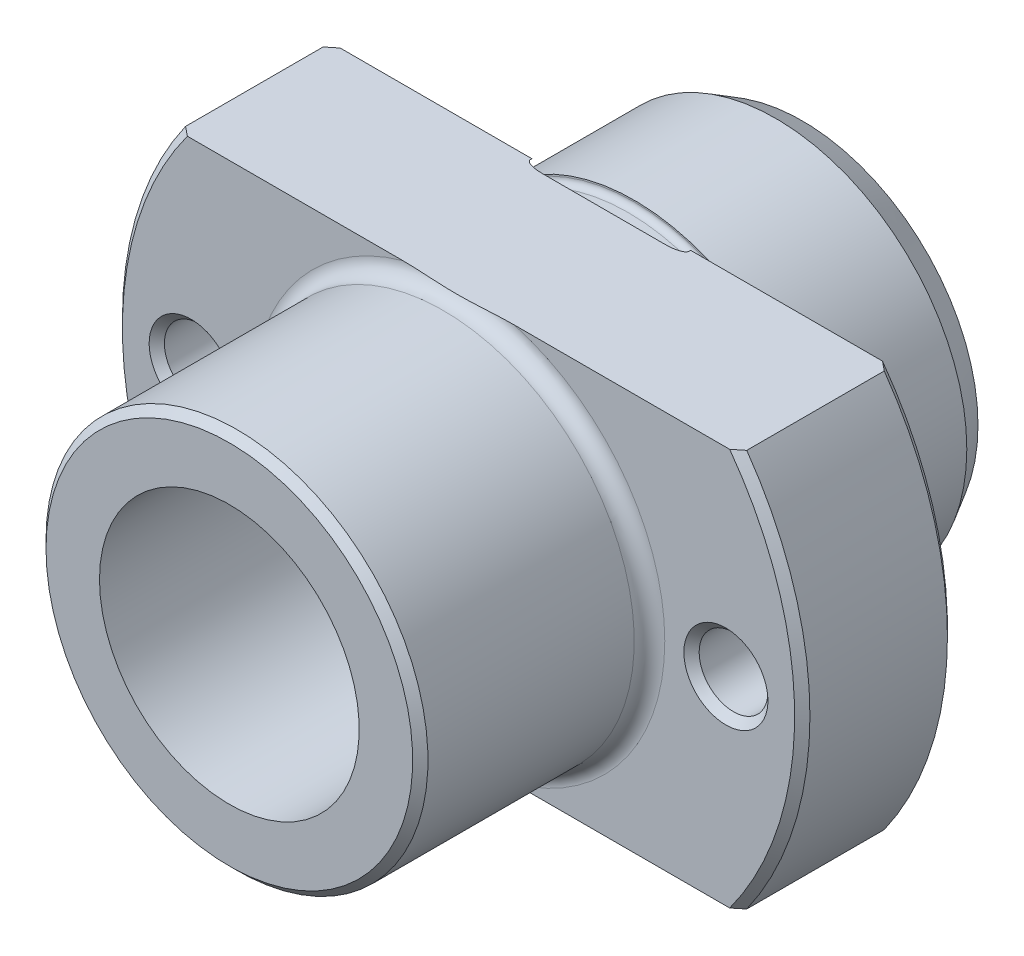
ISO-10303-21;
HEADER;
FILE_DESCRIPTION(('STEP AP214'),'2;1');
FILE_NAME('part.step','',(''),(''),'','','');
FILE_SCHEMA(('AUTOMOTIVE_DESIGN { 1 0 10303 214 1 1 1 1 }'));
ENDSEC;
DATA;
#1=APPLICATION_CONTEXT('core data for automotive mechanical design processes');
#2=APPLICATION_PROTOCOL_DEFINITION('international standard','automotive_design',2000,#1);
#3=PRODUCT_CONTEXT('',#1,'mechanical');
#4=PRODUCT('Part','Part','',(#3));
#5=PRODUCT_RELATED_PRODUCT_CATEGORY('part','',(#4));
#6=PRODUCT_DEFINITION_FORMATION('','',#4);
#7=PRODUCT_DEFINITION_CONTEXT('part definition',#1,'design');
#8=PRODUCT_DEFINITION('design','',#6,#7);
#9=PRODUCT_DEFINITION_SHAPE('','',#8);
#10=(LENGTH_UNIT() NAMED_UNIT(*) SI_UNIT(.MILLI.,.METRE.));
#11=(NAMED_UNIT(*) PLANE_ANGLE_UNIT() SI_UNIT($,.RADIAN.));
#12=(NAMED_UNIT(*) SI_UNIT($,.STERADIAN.) SOLID_ANGLE_UNIT());
#13=UNCERTAINTY_MEASURE_WITH_UNIT(LENGTH_MEASURE(1.E-05),#10,'distance_accuracy_value','');
#14=(GEOMETRIC_REPRESENTATION_CONTEXT(3) GLOBAL_UNCERTAINTY_ASSIGNED_CONTEXT((#13)) GLOBAL_UNIT_ASSIGNED_CONTEXT((#10,
#11,#12)) REPRESENTATION_CONTEXT('',''));
#15=CARTESIAN_POINT('',(0.,0.,0.));
#16=DIRECTION('',(0.,0.,1.));
#17=DIRECTION('',(1.,0.,0.));
#18=AXIS2_PLACEMENT_3D('',#15,#16,#17);
#19=CARTESIAN_POINT('',(0.,0.,-20.2470119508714));
#20=DIRECTION('',(0.,0.,-1.));
#21=DIRECTION('',(-1.,0.,0.));
#22=AXIS2_PLACEMENT_3D('',#19,#20,#21);
#23=CYLINDRICAL_SURFACE('',#22,8.5);
#24=CARTESIAN_POINT('',(0.,0.,25.));
#25=DIRECTION('',(0.,0.,-1.));
#26=DIRECTION('',(-1.,0.,0.));
#27=AXIS2_PLACEMENT_3D('',#24,#25,#26);
#28=CIRCLE('',#27,8.5);
#29=CARTESIAN_POINT('',(-8.5,0.,25.));
#30=VERTEX_POINT('',#29);
#31=EDGE_CURVE('E158',#30,#30,#28,.T.);
#32=ORIENTED_EDGE('',*,*,#31,.F.);
#33=EDGE_LOOP('',(#32));
#34=FACE_BOUND('',#33,.T.);
#35=CARTESIAN_POINT('',(0.,0.,-3.));
#36=DIRECTION('',(0.,0.,-1.));
#37=DIRECTION('',(-1.,0.,0.));
#38=AXIS2_PLACEMENT_3D('',#35,#36,#37);
#39=CIRCLE('',#38,8.5);
#40=CARTESIAN_POINT('',(-8.5,0.,-3.));
#41=VERTEX_POINT('',#40);
#42=EDGE_CURVE('E476',#41,#41,#39,.T.);
#43=ORIENTED_EDGE('',*,*,#42,.T.);
#44=EDGE_LOOP('',(#43));
#45=FACE_BOUND('',#44,.T.);
#46=ADVANCED_FACE('F14',(#34,#45),#23,.F.);
#47=CARTESIAN_POINT('',(12.5,0.,0.));
#48=DIRECTION('',(0.,0.,1.));
#49=DIRECTION('',(1.,0.,0.));
#50=AXIS2_PLACEMENT_3D('',#47,#48,#49);
#51=PLANE('',#50);
#52=CARTESIAN_POINT('',(-17.5,0.,0.));
#53=DIRECTION('',(0.,0.,1.));
#54=DIRECTION('',(1.,0.,0.));
#55=AXIS2_PLACEMENT_3D('',#52,#53,#54);
#56=CIRCLE('',#55,2.75);
#57=CARTESIAN_POINT('',(-14.75,0.,0.));
#58=VERTEX_POINT('',#57);
#59=EDGE_CURVE('E520',#58,#58,#56,.T.);
#60=ORIENTED_EDGE('',*,*,#59,.T.);
#61=EDGE_LOOP('',(#60));
#62=FACE_BOUND('',#61,.T.);
#63=DIRECTION('',(-1.,0.,0.));
#64=VECTOR('',#63,1.);
#65=CARTESIAN_POINT('',(12.5,-13.,0.));
#66=LINE('',#65,#64);
#67=CARTESIAN_POINT('',(-5.19615242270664,-13.,0.));
#68=VERTEX_POINT('',#67);
#69=CARTESIAN_POINT('',(-17.7482393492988,-13.,0.));
#70=VERTEX_POINT('',#69);
#71=EDGE_CURVE('E383',#68,#70,#66,.T.);
#72=ORIENTED_EDGE('',*,*,#71,.T.);
#73=CARTESIAN_POINT('',(0.,0.,0.));
#74=DIRECTION('',(0.,0.,1.));
#75=DIRECTION('',(1.,0.,0.));
#76=AXIS2_PLACEMENT_3D('',#73,#74,#75);
#77=CIRCLE('',#76,22.);
#78=CARTESIAN_POINT('',(-17.7482393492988,13.,0.));
#79=VERTEX_POINT('',#78);
#80=EDGE_CURVE('E272',#70,#79,#77,.F.);
#81=ORIENTED_EDGE('',*,*,#80,.T.);
#82=DIRECTION('',(1.,0.,0.));
#83=VECTOR('',#82,1.);
#84=CARTESIAN_POINT('',(12.5,13.,0.));
#85=LINE('',#84,#83);
#86=CARTESIAN_POINT('',(-5.19615242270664,13.,0.));
#87=VERTEX_POINT('',#86);
#88=EDGE_CURVE('E484',#79,#87,#85,.T.);
#89=ORIENTED_EDGE('',*,*,#88,.T.);
#90=CARTESIAN_POINT('',(0.,0.,0.));
#91=DIRECTION('',(0.,0.,1.));
#92=DIRECTION('',(1.,0.,0.));
#93=AXIS2_PLACEMENT_3D('',#90,#91,#92);
#94=CIRCLE('',#93,14.);
#95=EDGE_CURVE('E404',#68,#87,#94,.F.);
#96=ORIENTED_EDGE('',*,*,#95,.F.);
#97=EDGE_LOOP('',(#72,#81,#89,#96));
#98=FACE_BOUND('',#97,.T.);
#99=ADVANCED_FACE('F306',(#62,#98),#51,.F.);
#100=CARTESIAN_POINT('',(13.5,0.,10.));
#101=DIRECTION('',(0.,0.,-1.));
#102=DIRECTION('',(-1.,0.,0.));
#103=AXIS2_PLACEMENT_3D('',#100,#101,#102);
#104=PLANE('',#103);
#105=CARTESIAN_POINT('',(17.5,0.,10.));
#106=DIRECTION('',(0.,0.,-1.));
#107=DIRECTION('',(-1.,0.,0.));
#108=AXIS2_PLACEMENT_3D('',#105,#106,#107);
#109=CIRCLE('',#108,2.75000000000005);
#110=CARTESIAN_POINT('',(14.75,0.,10.));
#111=VERTEX_POINT('',#110);
#112=EDGE_CURVE('E503',#111,#111,#109,.T.);
#113=ORIENTED_EDGE('',*,*,#112,.T.);
#114=EDGE_LOOP('',(#113));
#115=FACE_BOUND('',#114,.T.);
#116=DIRECTION('',(1.,0.,0.));
#117=VECTOR('',#116,1.);
#118=CARTESIAN_POINT('',(13.5,-13.,10.));
#119=LINE('',#118,#117);
#120=CARTESIAN_POINT('',(3.64005494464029,-13.,10.));
#121=VERTEX_POINT('',#120);
#122=CARTESIAN_POINT('',(17.7482393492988,-13.,10.));
#123=VERTEX_POINT('',#122);
#124=EDGE_CURVE('E385',#121,#123,#119,.T.);
#125=ORIENTED_EDGE('',*,*,#124,.T.);
#126=CARTESIAN_POINT('',(0.,0.,10.));
#127=DIRECTION('',(0.,0.,-1.));
#128=DIRECTION('',(-1.,0.,0.));
#129=AXIS2_PLACEMENT_3D('',#126,#127,#128);
#130=CIRCLE('',#129,22.);
#131=CARTESIAN_POINT('',(17.7482393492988,13.,10.));
#132=VERTEX_POINT('',#131);
#133=EDGE_CURVE('E461',#123,#132,#130,.F.);
#134=ORIENTED_EDGE('',*,*,#133,.T.);
#135=DIRECTION('',(-1.,0.,0.));
#136=VECTOR('',#135,1.);
#137=CARTESIAN_POINT('',(13.5,13.,10.));
#138=LINE('',#137,#136);
#139=CARTESIAN_POINT('',(3.64005494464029,13.,10.));
#140=VERTEX_POINT('',#139);
#141=EDGE_CURVE('E366',#132,#140,#138,.T.);
#142=ORIENTED_EDGE('',*,*,#141,.T.);
#143=CARTESIAN_POINT('',(0.,0.,10.));
#144=DIRECTION('',(0.,0.,-1.));
#145=DIRECTION('',(-1.,0.,0.));
#146=AXIS2_PLACEMENT_3D('',#143,#144,#145);
#147=CIRCLE('',#146,13.5);
#148=EDGE_CURVE('E417',#140,#121,#147,.T.);
#149=ORIENTED_EDGE('',*,*,#148,.T.);
#150=EDGE_LOOP('',(#125,#134,#142,#149));
#151=FACE_BOUND('',#150,.T.);
#152=ADVANCED_FACE('F313',(#115,#151),#104,.F.);
#153=CARTESIAN_POINT('',(0.,0.,-20.2470119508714));
#154=DIRECTION('',(0.,0.,-1.));
#155=DIRECTION('',(-1.,0.,0.));
#156=AXIS2_PLACEMENT_3D('',#153,#154,#155);
#157=CYLINDRICAL_SURFACE('',#156,22.5);
#158=DIRECTION('',(0.,0.,1.));
#159=VECTOR('',#158,1.);
#160=CARTESIAN_POINT('',(-18.3643676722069,13.,-12.5));
#161=LINE('',#160,#159);
#162=CARTESIAN_POINT('',(-18.3643676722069,13.,0.499999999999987));
#163=VERTEX_POINT('',#162);
#164=CARTESIAN_POINT('',(-18.3643676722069,13.,9.5));
#165=VERTEX_POINT('',#164);
#166=EDGE_CURVE('E474',#163,#165,#161,.T.);
#167=ORIENTED_EDGE('',*,*,#166,.F.);
#168=CARTESIAN_POINT('',(0.,0.,0.499999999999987));
#169=DIRECTION('',(0.,0.,1.));
#170=DIRECTION('',(1.,0.,0.));
#171=AXIS2_PLACEMENT_3D('',#168,#169,#170);
#172=CIRCLE('',#171,22.5);
#173=CARTESIAN_POINT('',(-18.3643676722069,-13.,0.499999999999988));
#174=VERTEX_POINT('',#173);
#175=EDGE_CURVE('E277',#163,#174,#172,.T.);
#176=ORIENTED_EDGE('',*,*,#175,.T.);
#177=DIRECTION('',(0.,0.,1.));
#178=VECTOR('',#177,1.);
#179=CARTESIAN_POINT('',(-18.3643676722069,-13.,-12.5));
#180=LINE('',#179,#178);
#181=CARTESIAN_POINT('',(-18.3643676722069,-13.,9.5));
#182=VERTEX_POINT('',#181);
#183=EDGE_CURVE('E369',#174,#182,#180,.T.);
#184=ORIENTED_EDGE('',*,*,#183,.T.);
#185=CARTESIAN_POINT('',(0.,0.,9.5));
#186=DIRECTION('',(0.,0.,-1.));
#187=DIRECTION('',(-1.,0.,0.));
#188=AXIS2_PLACEMENT_3D('',#185,#186,#187);
#189=CIRCLE('',#188,22.5);
#190=EDGE_CURVE('E275',#182,#165,#189,.T.);
#191=ORIENTED_EDGE('',*,*,#190,.T.);
#192=EDGE_LOOP('',(#167,#176,#184,#191));
#193=FACE_BOUND('',#192,.T.);
#194=ADVANCED_FACE('F350',(#193),#157,.T.);
#195=CARTESIAN_POINT('',(0.,0.,0.));
#196=DIRECTION('',(0.,0.,-1.));
#197=DIRECTION('',(-1.,0.,0.));
#198=AXIS2_PLACEMENT_3D('',#195,#196,#197);
#199=CYLINDRICAL_SURFACE('',#198,14.);
#200=DIRECTION('',(0.,0.,-1.));
#201=VECTOR('',#200,1.);
#202=CARTESIAN_POINT('',(-5.19615242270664,13.,0.));
#203=LINE('',#202,#201);
#204=CARTESIAN_POINT('',(-5.19615242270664,13.,0.100000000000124));
#205=VERTEX_POINT('',#204);
#206=EDGE_CURVE('E483',#205,#87,#203,.T.);
#207=ORIENTED_EDGE('',*,*,#206,.F.);
#208=CARTESIAN_POINT('',(0.,0.,0.1));
#209=DIRECTION('',(0.,0.,-1.));
#210=DIRECTION('',(-1.,0.,0.));
#211=AXIS2_PLACEMENT_3D('',#208,#209,#210);
#212=CIRCLE('',#211,14.);
#213=CARTESIAN_POINT('',(-5.19615242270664,-13.,0.0999999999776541));
#214=VERTEX_POINT('',#213);
#215=EDGE_CURVE('E156',#205,#214,#212,.F.);
#216=ORIENTED_EDGE('',*,*,#215,.T.);
#217=DIRECTION('',(0.,0.,-1.));
#218=VECTOR('',#217,1.);
#219=CARTESIAN_POINT('',(-5.19615242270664,-13.,0.));
#220=LINE('',#219,#218);
#221=EDGE_CURVE('E382',#68,#214,#220,.F.);
#222=ORIENTED_EDGE('',*,*,#221,.F.);
#223=ORIENTED_EDGE('',*,*,#95,.T.);
#224=EDGE_LOOP('',(#207,#216,#222,#223));
#225=FACE_BOUND('',#224,.T.);
#226=ADVANCED_FACE('F490',(#225),#199,.F.);
#227=CARTESIAN_POINT('',(0.,0.,0.1));
#228=DIRECTION('',(0.,0.,-1.));
#229=DIRECTION('',(-1.,0.,0.));
#230=AXIS2_PLACEMENT_3D('',#227,#228,#229);
#231=TOROIDAL_SURFACE('',#230,13.6,0.4);
#232=ORIENTED_EDGE('',*,*,#215,.F.);
#233=CARTESIAN_POINT('',(-5.18349301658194,13.,0.0389026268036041));
#234=CARTESIAN_POINT('',(-5.18688752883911,13.,0.0470377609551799));
#235=CARTESIAN_POINT('',(-5.18968757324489,13.,0.0554239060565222));
#236=CARTESIAN_POINT('',(-5.1938593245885,13.,0.0725453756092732));
#237=CARTESIAN_POINT('',(-5.19523238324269,13.,0.0812803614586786));
#238=CARTESIAN_POINT('',(-5.19641018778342,13.,0.098889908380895));
#239=CARTESIAN_POINT('',(-5.19620929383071,13.,0.107764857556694));
#240=CARTESIAN_POINT('',(-5.19424906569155,13.,0.125340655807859));
#241=CARTESIAN_POINT('',(-5.19248876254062,13.,0.13404139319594));
#242=CARTESIAN_POINT('',(-5.18711674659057,13.,0.152664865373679));
#243=CARTESIAN_POINT('',(-5.18321526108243,13.,0.162502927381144));
#244=CARTESIAN_POINT('',(-5.17387272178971,13.,0.18141537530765));
#245=CARTESIAN_POINT('',(-5.16842871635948,13.,0.190488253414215));
#246=CARTESIAN_POINT('',(-5.15298012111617,13.,0.212774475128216));
#247=CARTESIAN_POINT('',(-5.14214352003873,13.,0.225404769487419));
#248=CARTESIAN_POINT('',(-5.11874570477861,13.,0.248933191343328));
#249=CARTESIAN_POINT('',(-5.10617994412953,13.,0.259826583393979));
#250=CARTESIAN_POINT('',(-5.06674205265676,13.,0.29048612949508));
#251=CARTESIAN_POINT('',(-5.03822876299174,13.,0.308113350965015));
#252=CARTESIAN_POINT('',(-4.97920205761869,13.,0.339524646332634));
#253=CARTESIAN_POINT('',(-4.94868285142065,13.,0.353296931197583));
#254=CARTESIAN_POINT('',(-4.86934264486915,13.,0.384907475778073));
#255=CARTESIAN_POINT('',(-4.81974364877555,13.,0.40077541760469));
#256=CARTESIAN_POINT('',(-4.71928800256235,13.,0.427977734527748));
#257=CARTESIAN_POINT('',(-4.66842880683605,13.,0.43930197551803));
#258=CARTESIAN_POINT('',(-4.56583367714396,13.,0.458552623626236));
#259=CARTESIAN_POINT('',(-4.51409474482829,13.,0.466462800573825));
#260=CARTESIAN_POINT('',(-4.41033435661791,13.,0.479510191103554));
#261=CARTESIAN_POINT('',(-4.35831323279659,13.,0.484650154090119));
#262=CARTESIAN_POINT('',(-4.24878777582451,13.,0.493037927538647));
#263=CARTESIAN_POINT('',(-4.19126495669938,13.,0.496039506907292));
#264=CARTESIAN_POINT('',(-4.07614037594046,13.,0.499666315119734));
#265=CARTESIAN_POINT('',(-4.01853860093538,13.,0.500291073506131));
#266=CARTESIAN_POINT('',(-3.84562407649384,13.,0.499044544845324));
#267=CARTESIAN_POINT('',(-3.7303291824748,13.,0.494044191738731));
#268=CARTESIAN_POINT('',(-3.50046301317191,13.,0.47700827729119));
#269=CARTESIAN_POINT('',(-3.38589088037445,13.,0.464983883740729));
#270=CARTESIAN_POINT('',(-3.21480906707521,13.,0.441721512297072));
#271=CARTESIAN_POINT('',(-3.15793532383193,13.,0.433101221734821));
#272=CARTESIAN_POINT('',(-3.04450927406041,13.,0.413971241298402));
#273=CARTESIAN_POINT('',(-2.98795691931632,13.,0.403461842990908));
#274=CARTESIAN_POINT('',(-2.8977859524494,13.,0.384866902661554));
#275=CARTESIAN_POINT('',(-2.86402109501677,13.,0.377487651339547));
#276=CARTESIAN_POINT('',(-2.79669799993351,13.,0.361796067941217));
#277=CARTESIAN_POINT('',(-2.76313981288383,13.,0.353483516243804));
#278=CARTESIAN_POINT('',(-2.69641400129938,13.,0.335740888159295));
#279=CARTESIAN_POINT('',(-2.66324557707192,13.,0.326313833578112));
#280=CARTESIAN_POINT('',(-2.59737035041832,13.,0.305978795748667));
#281=CARTESIAN_POINT('',(-2.56466331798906,13.,0.295071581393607));
#282=CARTESIAN_POINT('',(-2.51506676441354,13.,0.276643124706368));
#283=CARTESIAN_POINT('',(-2.49788793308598,13.,0.269902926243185));
#284=CARTESIAN_POINT('',(-2.46385264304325,13.,0.255581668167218));
#285=CARTESIAN_POINT('',(-2.44699657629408,13.,0.247999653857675));
#286=CARTESIAN_POINT('',(-2.41399889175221,13.,0.231748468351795));
#287=CARTESIAN_POINT('',(-2.39785232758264,13.,0.223089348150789));
#288=CARTESIAN_POINT('',(-2.36652601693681,13.,0.20404380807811));
#289=CARTESIAN_POINT('',(-2.35134609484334,13.,0.193657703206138));
#290=CARTESIAN_POINT('',(-2.33031621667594,13.,0.175831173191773));
#291=CARTESIAN_POINT('',(-2.32356488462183,13.,0.169474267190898));
#292=CARTESIAN_POINT('',(-2.31118053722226,13.,0.155759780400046));
#293=CARTESIAN_POINT('',(-2.30554028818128,13.,0.148409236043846));
#294=CARTESIAN_POINT('',(-2.29869663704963,13.,0.136672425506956));
#295=CARTESIAN_POINT('',(-2.29671525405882,13.,0.132745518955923));
#296=CARTESIAN_POINT('',(-2.29336140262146,13.,0.124636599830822));
#297=CARTESIAN_POINT('',(-2.29198840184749,13.,0.120454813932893));
#298=CARTESIAN_POINT('',(-2.28998605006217,13.,0.111867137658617));
#299=CARTESIAN_POINT('',(-2.28936421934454,13.,0.107459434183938));
#300=CARTESIAN_POINT('',(-2.2889776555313,13.,0.0986066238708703));
#301=CARTESIAN_POINT('',(-2.2892125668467,13.,0.0941615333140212));
#302=CARTESIAN_POINT('',(-2.29043548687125,13.,0.0858533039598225));
#303=CARTESIAN_POINT('',(-2.2913427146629,13.,0.0819776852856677));
#304=CARTESIAN_POINT('',(-2.29372287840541,13.,0.0744060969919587));
#305=CARTESIAN_POINT('',(-2.29519619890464,13.,0.0707102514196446));
#306=CARTESIAN_POINT('',(-2.29967200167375,13.,0.0612653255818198));
#307=CARTESIAN_POINT('',(-2.30305218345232,13.,0.0556967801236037));
#308=CARTESIAN_POINT('',(-2.31060852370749,13.,0.0451293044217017));
#309=CARTESIAN_POINT('',(-2.31478731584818,13.,0.0401323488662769));
#310=CARTESIAN_POINT('',(-2.33033446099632,13.,0.0234289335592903));
#311=CARTESIAN_POINT('',(-2.34303001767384,13.,0.0129861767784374));
#312=CARTESIAN_POINT('',(-2.36969818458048,13.,-0.00610828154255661));
#313=CARTESIAN_POINT('',(-2.38367870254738,13.,-0.0147476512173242));
#314=CARTESIAN_POINT('',(-2.42448521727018,13.,-0.0377195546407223));
#315=CARTESIAN_POINT('',(-2.4521065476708,13.,-0.0506308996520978));
#316=CARTESIAN_POINT('',(-2.50827872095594,13.,-0.0742826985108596));
#317=CARTESIAN_POINT('',(-2.53683195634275,13.,-0.0850169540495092));
#318=CARTESIAN_POINT('',(-2.59453272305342,13.,-0.105027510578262));
#319=CARTESIAN_POINT('',(-2.6236816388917,13.,-0.114299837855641));
#320=CARTESIAN_POINT('',(-2.68225770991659,13.,-0.131734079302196));
#321=CARTESIAN_POINT('',(-2.71168442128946,13.,-0.139897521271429));
#322=CARTESIAN_POINT('',(-2.80024717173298,13.,-0.163086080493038));
#323=CARTESIAN_POINT('',(-2.85971979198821,13.,-0.176826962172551));
#324=CARTESIAN_POINT('',(-2.97919477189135,13.,-0.201809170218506));
#325=CARTESIAN_POINT('',(-3.03919732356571,13.,-0.213049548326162));
#326=CARTESIAN_POINT('',(-3.15967235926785,13.,-0.233419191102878));
#327=CARTESIAN_POINT('',(-3.22014549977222,13.,-0.242544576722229));
#328=CARTESIAN_POINT('',(-3.3413587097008,13.,-0.258815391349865));
#329=CARTESIAN_POINT('',(-3.40209880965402,13.,-0.2659605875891));
#330=CARTESIAN_POINT('',(-3.58417066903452,13.,-0.284445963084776));
#331=CARTESIAN_POINT('',(-3.70581863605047,13.,-0.292913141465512));
#332=CARTESIAN_POINT('',(-3.88840291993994,13.,-0.299163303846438));
#333=CARTESIAN_POINT('',(-3.94924297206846,13.,-0.300173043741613));
#334=CARTESIAN_POINT('',(-4.07091244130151,13.,-0.29977772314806));
#335=CARTESIAN_POINT('',(-4.13174185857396,13.,-0.29837304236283));
#336=CARTESIAN_POINT('',(-4.25386935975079,13.,-0.292752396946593));
#337=CARTESIAN_POINT('',(-4.31516627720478,13.,-0.288509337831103));
#338=CARTESIAN_POINT('',(-4.43749978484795,13.,-0.276587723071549));
#339=CARTESIAN_POINT('',(-4.49853601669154,13.,-0.268905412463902));
#340=CARTESIAN_POINT('',(-4.62169055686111,13.,-0.248906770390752));
#341=CARTESIAN_POINT('',(-4.6837900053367,13.,-0.236464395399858));
#342=CARTESIAN_POINT('',(-4.77563082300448,13.,-0.21299947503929));
#343=CARTESIAN_POINT('',(-4.80598784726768,13.,-0.204391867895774));
#344=CARTESIAN_POINT('',(-4.86609383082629,13.,-0.185176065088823));
#345=CARTESIAN_POINT('',(-4.8958425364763,13.,-0.174567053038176));
#346=CARTESIAN_POINT('',(-4.94790715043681,13.,-0.153381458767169));
#347=CARTESIAN_POINT('',(-4.97042511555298,13.,-0.143305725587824));
#348=CARTESIAN_POINT('',(-5.01444979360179,13.,-0.121175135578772));
#349=CARTESIAN_POINT('',(-5.03595819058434,13.,-0.109123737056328));
#350=CARTESIAN_POINT('',(-5.07365755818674,13.,-0.0847728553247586));
#351=CARTESIAN_POINT('',(-5.09011653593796,13.,-0.0728935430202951));
#352=CARTESIAN_POINT('',(-5.12115419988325,13.,-0.0468721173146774));
#353=CARTESIAN_POINT('',(-5.13573896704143,13.,-0.0327376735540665));
#354=CARTESIAN_POINT('',(-5.15573154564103,13.,-0.00870862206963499));
#355=CARTESIAN_POINT('',(-5.16230433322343,13.,0.000207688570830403));
#356=CARTESIAN_POINT('',(-5.17405830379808,13.,0.0189199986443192));
#357=CARTESIAN_POINT('',(-5.17924184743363,13.,0.0287144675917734));
#358=CARTESIAN_POINT('',(-5.18349301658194,13.,0.0389026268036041));
#359=B_SPLINE_CURVE_WITH_KNOTS('',3,(#233,#234,#235,#236,#237,#238,#239,#240,#241,#242,#243,
#244,#245,#246,#247,#248,#249,#250,#251,#252,#253,#254,#255,#256,#257,#258,#259,#260,#261,#262,
#263,#264,#265,#266,#267,#268,#269,#270,#271,#272,#273,#274,#275,#276,#277,#278,#279,#280,#281,
#282,#283,#284,#285,#286,#287,#288,#289,#290,#291,#292,#293,#294,#295,#296,#297,#298,#299,#300,
#301,#302,#303,#304,#305,#306,#307,#308,#309,#310,#311,#312,#313,#314,#315,#316,#317,#318,#319,
#320,#321,#322,#323,#324,#325,#326,#327,#328,#329,#330,#331,#332,#333,#334,#335,#336,#337,#338,
#339,#340,#341,#342,#343,#344,#345,#346,#347,#348,#349,#350,#351,#352,#353,#354,#355,#356,#357,
#358),.UNSPECIFIED.,.T.,.F.,(4,2,2,2,2,2,2,2,2,2,2,2,2,2,2,2,2,2,2,2,2,2,2,2,2,2,2,2,2,2,2,2,2,
2,2,2,2,2,2,2,2,2,2,2,2,2,2,2,2,2,2,2,2,2,2,2,2,2,2,2,2,2,4),(0.,0.0264176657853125,
0.0528102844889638,0.0792975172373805,0.105801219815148,0.137375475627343,0.169010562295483,
0.218653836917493,0.26843022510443,0.368435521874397,0.468743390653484,0.624585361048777,
0.780773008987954,0.937695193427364,1.09446134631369,1.26720460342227,1.43998205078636,
1.78591793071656,2.13130528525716,2.30385160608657,2.47637131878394,2.5800469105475,
2.68374695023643,2.78717200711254,2.89054354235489,2.94589157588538,3.00130303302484,
3.05623155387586,3.11115006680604,3.13890806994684,3.16647890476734,3.17963550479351,
3.19278057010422,3.206056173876,3.21932626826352,3.23121762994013,3.24311708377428,
3.26254593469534,3.28203999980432,3.33097358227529,3.38023154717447,3.47145954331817,
3.562943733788,3.65467245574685,3.74627348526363,3.92930561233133,4.11240703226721,
4.29584166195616,4.47929784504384,4.84479941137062,5.02730999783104,5.20979188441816,
5.39404103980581,5.5784918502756,5.76820891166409,5.86282237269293,5.95747451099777,
6.03141563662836,6.1052286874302,6.16599807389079,6.22656502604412,6.25970626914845,
6.29279083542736),.UNSPECIFIED.);
#360=CARTESIAN_POINT('',(-3.99499687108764,13.,0.5));
#361=VERTEX_POINT('',#360);
#362=EDGE_CURVE('E137',#205,#361,#359,.T.);
#363=ORIENTED_EDGE('',*,*,#362,.T.);
#364=CARTESIAN_POINT('',(0.,0.,0.5));
#365=DIRECTION('',(0.,0.,-1.));
#366=DIRECTION('',(-1.,0.,0.));
#367=AXIS2_PLACEMENT_3D('',#364,#365,#366);
#368=CIRCLE('',#367,13.6);
#369=CARTESIAN_POINT('',(-3.99499687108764,-13.,0.5));
#370=VERTEX_POINT('',#369);
#371=EDGE_CURVE('E148',#370,#361,#368,.T.);
#372=ORIENTED_EDGE('',*,*,#371,.F.);
#373=CARTESIAN_POINT('',(-5.18349301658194,-13.,0.0389026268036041));
#374=CARTESIAN_POINT('',(-5.17798142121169,-13.,0.0256971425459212));
#375=CARTESIAN_POINT('',(-5.17089594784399,-13.,0.0131403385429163));
#376=CARTESIAN_POINT('',(-5.15458819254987,-13.,-0.0105218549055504));
#377=CARTESIAN_POINT('',(-5.14535329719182,-13.,-0.0216180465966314));
#378=CARTESIAN_POINT('',(-5.11955329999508,-13.,-0.048729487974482));
#379=CARTESIAN_POINT('',(-5.10191285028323,-13.,-0.0637055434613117));
#380=CARTESIAN_POINT('',(-5.06477594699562,-13.,-0.09103713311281));
#381=CARTESIAN_POINT('',(-5.04527711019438,-13.,-0.103389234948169));
#382=CARTESIAN_POINT('',(-4.9973270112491,-13.,-0.130560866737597));
#383=CARTESIAN_POINT('',(-4.96835766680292,-13.,-0.144455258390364));
#384=CARTESIAN_POINT('',(-4.9092352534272,-13.,-0.169495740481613));
#385=CARTESIAN_POINT('',(-4.87907990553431,-13.,-0.180636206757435));
#386=CARTESIAN_POINT('',(-4.81791079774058,-13.,-0.200837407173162));
#387=CARTESIAN_POINT('',(-4.78689331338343,-13.,-0.209886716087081));
#388=CARTESIAN_POINT('',(-4.72444245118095,-13.,-0.226246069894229));
#389=CARTESIAN_POINT('',(-4.69300947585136,-13.,-0.233557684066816));
#390=CARTESIAN_POINT('',(-4.61371335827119,-13.,-0.250120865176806));
#391=CARTESIAN_POINT('',(-4.56565927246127,-13.,-0.258455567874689));
#392=CARTESIAN_POINT('',(-4.46916771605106,-13.,-0.272534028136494));
#393=CARTESIAN_POINT('',(-4.42073008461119,-13.,-0.278276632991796));
#394=CARTESIAN_POINT('',(-4.27494646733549,-13.,-0.292311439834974));
#395=CARTESIAN_POINT('',(-4.17728831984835,-13.,-0.297381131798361));
#396=CARTESIAN_POINT('',(-3.98197064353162,-13.,-0.301042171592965));
#397=CARTESIAN_POINT('',(-3.88431115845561,-13.,-0.299637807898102));
#398=CARTESIAN_POINT('',(-3.68920564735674,-13.,-0.291399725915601));
#399=CARTESIAN_POINT('',(-3.59175968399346,-13.,-0.284564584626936));
#400=CARTESIAN_POINT('',(-3.38792146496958,-13.,-0.265044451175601));
#401=CARTESIAN_POINT('',(-3.28157656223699,-13.,-0.2518571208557));
#402=CARTESIAN_POINT('',(-3.12283860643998,-13.,-0.227405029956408));
#403=CARTESIAN_POINT('',(-3.07007855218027,-13.,-0.218480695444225));
#404=CARTESIAN_POINT('',(-2.9648921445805,-13.,-0.198881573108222));
#405=CARTESIAN_POINT('',(-2.91246573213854,-13.,-0.188207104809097));
#406=CARTESIAN_POINT('',(-2.80558470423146,-13.,-0.164206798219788));
#407=CARTESIAN_POINT('',(-2.75115226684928,-13.,-0.150778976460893));
#408=CARTESIAN_POINT('',(-2.67020497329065,-13.,-0.128228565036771));
#409=CARTESIAN_POINT('',(-2.64335354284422,-13.,-0.120315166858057));
#410=CARTESIAN_POINT('',(-2.58997914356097,-13.,-0.103455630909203));
#411=CARTESIAN_POINT('',(-2.56345607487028,-13.,-0.0945098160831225));
#412=CARTESIAN_POINT('',(-2.51954922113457,-13.,-0.0783680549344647));
#413=CARTESIAN_POINT('',(-2.50202276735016,-13.,-0.0715613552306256));
#414=CARTESIAN_POINT('',(-2.46729667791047,-13.,-0.0570968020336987));
#415=CARTESIAN_POINT('',(-2.45009736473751,-13.,-0.0494381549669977));
#416=CARTESIAN_POINT('',(-2.41649349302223,-13.,-0.0330511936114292));
#417=CARTESIAN_POINT('',(-2.40008148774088,-13.,-0.0243381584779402));
#418=CARTESIAN_POINT('',(-2.36821959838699,-13.,-0.00517029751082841));
#419=CARTESIAN_POINT('',(-2.35276965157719,-13.,0.00528441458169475));
#420=CARTESIAN_POINT('',(-2.33133432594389,-13.,0.0232406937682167));
#421=CARTESIAN_POINT('',(-2.3244471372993,-13.,0.0296455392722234));
#422=CARTESIAN_POINT('',(-2.31179574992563,-13.,0.0434732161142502));
#423=CARTESIAN_POINT('',(-2.30602424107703,-13.,0.0508888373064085));
#424=CARTESIAN_POINT('',(-2.29902856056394,-13.,0.0627053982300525));
#425=CARTESIAN_POINT('',(-2.29701219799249,-13.,0.0666313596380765));
#426=CARTESIAN_POINT('',(-2.29358463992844,-13.,0.0747424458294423));
#427=CARTESIAN_POINT('',(-2.29217293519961,-13.,0.0789273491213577));
#428=CARTESIAN_POINT('',(-2.29009153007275,-13.,0.0875290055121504));
#429=CARTESIAN_POINT('',(-2.28942952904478,-13.,0.0919476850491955));
#430=CARTESIAN_POINT('',(-2.2889677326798,-13.,0.100829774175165));
#431=CARTESIAN_POINT('',(-2.28916750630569,-13.,0.105293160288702));
#432=CARTESIAN_POINT('',(-2.29033187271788,-13.,0.113632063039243));
#433=CARTESIAN_POINT('',(-2.29121326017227,-13.,0.117519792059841));
#434=CARTESIAN_POINT('',(-2.2935480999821,-13.,0.125117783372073));
#435=CARTESIAN_POINT('',(-2.29500196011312,-13.,0.128827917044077));
#436=CARTESIAN_POINT('',(-2.2994055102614,-13.,0.138248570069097));
#437=CARTESIAN_POINT('',(-2.30272508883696,-13.,0.143784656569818));
#438=CARTESIAN_POINT('',(-2.31015758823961,-13.,0.154295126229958));
#439=CARTESIAN_POINT('',(-2.31427308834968,-13.,0.15926759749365));
#440=CARTESIAN_POINT('',(-2.32951281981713,-13.,0.175799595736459));
#441=CARTESIAN_POINT('',(-2.34194054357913,-13.,0.186130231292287));
#442=CARTESIAN_POINT('',(-2.36806554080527,-13.,0.205030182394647));
#443=CARTESIAN_POINT('',(-2.38177067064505,-13.,0.213587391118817));
#444=CARTESIAN_POINT('',(-2.42160953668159,-13.,0.23624502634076));
#445=CARTESIAN_POINT('',(-2.44852060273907,-13.,0.248970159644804));
#446=CARTESIAN_POINT('',(-2.50326346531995,-13.,0.272295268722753));
#447=CARTESIAN_POINT('',(-2.53109762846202,-13.,0.28288919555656));
#448=CARTESIAN_POINT('',(-2.58735314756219,-13.,0.302648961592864));
#449=CARTESIAN_POINT('',(-2.61577586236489,-13.,0.311810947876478));
#450=CARTESIAN_POINT('',(-2.67289851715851,-13.,0.32904754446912));
#451=CARTESIAN_POINT('',(-2.70159801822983,-13.,0.337123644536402));
#452=CARTESIAN_POINT('',(-2.7879386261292,-13.,0.360068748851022));
#453=CARTESIAN_POINT('',(-2.84591298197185,-13.,0.37368454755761));
#454=CARTESIAN_POINT('',(-2.96238107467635,-13.,0.398487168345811));
#455=CARTESIAN_POINT('',(-3.0208749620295,-13.,0.409673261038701));
#456=CARTESIAN_POINT('',(-3.13832349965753,-13.,0.430008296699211));
#457=CARTESIAN_POINT('',(-3.19727878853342,-13.,0.439153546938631));
#458=CARTESIAN_POINT('',(-3.31545801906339,-13.,0.455549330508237));
#459=CARTESIAN_POINT('',(-3.37468200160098,-13.,0.462799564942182));
#460=CARTESIAN_POINT('',(-3.55217806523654,-13.,0.48173273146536));
#461=CARTESIAN_POINT('',(-3.67075284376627,-13.,0.490679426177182));
#462=CARTESIAN_POINT('',(-3.9082246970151,-13.,0.500587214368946));
#463=CARTESIAN_POINT('',(-4.02712160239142,-13.,0.501551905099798));
#464=CARTESIAN_POINT('',(-4.20814941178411,-13.,0.495300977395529));
#465=CARTESIAN_POINT('',(-4.27040634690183,-13.,0.491754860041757));
#466=CARTESIAN_POINT('',(-4.3947006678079,-13.,0.481290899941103));
#467=CARTESIAN_POINT('',(-4.45673781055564,-13.,0.474370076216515));
#468=CARTESIAN_POINT('',(-4.58142287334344,-13.,0.456132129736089));
#469=CARTESIAN_POINT('',(-4.64405975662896,-13.,0.444733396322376));
#470=CARTESIAN_POINT('',(-4.73690456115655,-13.,0.423142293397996));
#471=CARTESIAN_POINT('',(-4.7676369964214,-13.,0.415206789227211));
#472=CARTESIAN_POINT('',(-4.82856261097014,-13.,0.39750009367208));
#473=CARTESIAN_POINT('',(-4.85875610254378,-13.,0.387730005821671));
#474=CARTESIAN_POINT('',(-4.91029136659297,-13.,0.368804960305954));
#475=CARTESIAN_POINT('',(-4.93183056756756,-13.,0.360190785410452));
#476=CARTESIAN_POINT('',(-4.9742836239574,-13.,0.341414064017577));
#477=CARTESIAN_POINT('',(-4.99519629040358,-13.,0.331248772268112));
#478=CARTESIAN_POINT('',(-5.03614165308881,-13.,0.308888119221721));
#479=CARTESIAN_POINT('',(-5.05616581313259,-13.,0.296676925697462));
#480=CARTESIAN_POINT('',(-5.09439882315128,-13.,0.269687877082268));
#481=CARTESIAN_POINT('',(-5.11261429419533,-13.,0.254919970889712));
#482=CARTESIAN_POINT('',(-5.1369023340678,-13.,0.230748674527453));
#483=CARTESIAN_POINT('',(-5.14428199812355,-13.,0.22266747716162));
#484=CARTESIAN_POINT('',(-5.15803003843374,-13.,0.205662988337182));
#485=CARTESIAN_POINT('',(-5.16439786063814,-13.,0.196739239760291));
#486=CARTESIAN_POINT('',(-5.17580677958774,-13.,0.177904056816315));
#487=CARTESIAN_POINT('',(-5.18082989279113,-13.,0.167981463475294));
#488=CARTESIAN_POINT('',(-5.18892894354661,-13.,0.147372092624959));
#489=CARTESIAN_POINT('',(-5.19201015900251,-13.,0.136687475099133));
#490=CARTESIAN_POINT('',(-5.1953683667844,-13.,0.117420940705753));
#491=CARTESIAN_POINT('',(-5.19612836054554,-13.,0.108922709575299));
#492=CARTESIAN_POINT('',(-5.19617528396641,-13.,0.0919219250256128));
#493=CARTESIAN_POINT('',(-5.19546276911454,-13.,0.0834193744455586));
#494=CARTESIAN_POINT('',(-5.19300715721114,-13.,0.0688359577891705));
#495=CARTESIAN_POINT('',(-5.191579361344,-13.,0.0626990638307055));
#496=CARTESIAN_POINT('',(-5.18803313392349,-13.,0.0506339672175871));
#497=CARTESIAN_POINT('',(-5.18591504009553,-13.,0.0447056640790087));
#498=CARTESIAN_POINT('',(-5.18349301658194,-13.,0.0389026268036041));
#499=B_SPLINE_CURVE_WITH_KNOTS('',3,(#373,#374,#375,#376,#377,#378,#379,#380,#381,#382,#383,
#384,#385,#386,#387,#388,#389,#390,#391,#392,#393,#394,#395,#396,#397,#398,#399,#400,#401,#402,
#403,#404,#405,#406,#407,#408,#409,#410,#411,#412,#413,#414,#415,#416,#417,#418,#419,#420,#421,
#422,#423,#424,#425,#426,#427,#428,#429,#430,#431,#432,#433,#434,#435,#436,#437,#438,#439,#440,
#441,#442,#443,#444,#445,#446,#447,#448,#449,#450,#451,#452,#453,#454,#455,#456,#457,#458,#459,
#460,#461,#462,#463,#464,#465,#466,#467,#468,#469,#470,#471,#472,#473,#474,#475,#476,#477,#478,
#479,#480,#481,#482,#483,#484,#485,#486,#487,#488,#489,#490,#491,#492,#493,#494,#495,#496,#497,
#498),.UNSPECIFIED.,.T.,.F.,(4,2,2,2,2,2,2,2,2,2,2,2,2,2,2,2,2,2,2,2,2,2,2,2,2,2,2,2,2,2,2,2,2,
2,2,2,2,2,2,2,2,2,2,2,2,2,2,2,2,2,2,2,2,2,2,2,2,2,2,2,2,2,4),(0.,0.0428973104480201,
0.0860530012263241,0.155081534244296,0.224199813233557,0.320357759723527,0.416710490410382,
0.513577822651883,0.61035734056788,0.756573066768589,0.902853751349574,1.1958970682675,
1.48874629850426,1.78167228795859,2.10296124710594,2.26346665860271,2.42394279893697,
2.59205407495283,2.67602036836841,2.75996046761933,2.8163523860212,2.87279727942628,
2.92850486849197,2.98420882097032,3.01236295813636,3.04032585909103,3.05352798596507,
3.06671897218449,3.08004423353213,3.09336283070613,3.10527147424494,3.11718861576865,
3.13644132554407,3.15575750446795,3.20386469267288,3.25229020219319,3.34135819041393,
3.43067551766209,3.52022918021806,3.60965869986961,3.78823038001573,3.96685559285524,
4.14580143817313,4.32477549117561,4.68126983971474,5.0376035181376,5.22460449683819,
5.41177095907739,5.60251982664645,5.69770052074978,5.79282414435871,5.86237428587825,
5.93204898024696,6.00229011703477,6.07226382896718,6.10503558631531,6.13782522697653,
6.17103365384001,6.20415142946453,6.22962756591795,6.25509409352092,6.27395416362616,
6.29280502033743),.UNSPECIFIED.);
#500=EDGE_CURVE('E138',#370,#214,#499,.T.);
#501=ORIENTED_EDGE('',*,*,#500,.T.);
#502=EDGE_LOOP('',(#232,#363,#372,#501));
#503=FACE_BOUND('',#502,.T.);
#504=ADVANCED_FACE('F337',(#503),#231,.F.);
#505=CARTESIAN_POINT('',(17.5,0.,0.));
#506=DIRECTION('',(0.,0.,1.));
#507=DIRECTION('',(1.,0.,0.));
#508=AXIS2_PLACEMENT_3D('',#505,#506,#507);
#509=CIRCLE('',#508,2.75);
#510=CARTESIAN_POINT('',(20.25,0.,0.));
#511=VERTEX_POINT('',#510);
#512=EDGE_CURVE('E505',#511,#511,#509,.T.);
#513=ORIENTED_EDGE('',*,*,#512,.T.);
#514=EDGE_LOOP('',(#513));
#515=FACE_BOUND('',#514,.T.);
#516=CARTESIAN_POINT('',(5.19615242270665,13.,0.));
#517=VERTEX_POINT('',#516);
#518=CARTESIAN_POINT('',(17.7482393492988,13.,0.));
#519=VERTEX_POINT('',#518);
#520=EDGE_CURVE('E481',#517,#519,#85,.T.);
#521=ORIENTED_EDGE('',*,*,#520,.T.);
#522=CARTESIAN_POINT('',(0.,0.,0.));
#523=DIRECTION('',(0.,0.,1.));
#524=DIRECTION('',(1.,0.,0.));
#525=AXIS2_PLACEMENT_3D('',#522,#523,#524);
#526=CIRCLE('',#525,22.);
#527=CARTESIAN_POINT('',(17.7482393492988,-13.,0.));
#528=VERTEX_POINT('',#527);
#529=EDGE_CURVE('E269',#519,#528,#526,.F.);
#530=ORIENTED_EDGE('',*,*,#529,.T.);
#531=CARTESIAN_POINT('',(5.19615242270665,-13.,0.));
#532=VERTEX_POINT('',#531);
#533=EDGE_CURVE('E380',#528,#532,#66,.T.);
#534=ORIENTED_EDGE('',*,*,#533,.T.);
#535=EDGE_CURVE('E399',#517,#532,#94,.F.);
#536=ORIENTED_EDGE('',*,*,#535,.F.);
#537=EDGE_LOOP('',(#521,#530,#534,#536));
#538=FACE_BOUND('',#537,.T.);
#539=ADVANCED_FACE('F316',(#515,#538),#51,.F.);
#540=CARTESIAN_POINT('',(0.,0.,-20.2470119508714));
#541=DIRECTION('',(0.,0.,-1.));
#542=DIRECTION('',(-1.,0.,0.));
#543=AXIS2_PLACEMENT_3D('',#540,#541,#542);
#544=CYLINDRICAL_SURFACE('',#543,12.5);
#545=CARTESIAN_POINT('',(0.,0.,-10.7679491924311));
#546=DIRECTION('',(0.,0.,1.));
#547=DIRECTION('',(1.,0.,0.));
#548=AXIS2_PLACEMENT_3D('',#545,#546,#547);
#549=CIRCLE('',#548,12.5);
#550=CARTESIAN_POINT('',(12.5,0.,-10.7679491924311));
#551=VERTEX_POINT('',#550);
#552=EDGE_CURVE('E438',#551,#551,#549,.T.);
#553=ORIENTED_EDGE('',*,*,#552,.T.);
#554=EDGE_LOOP('',(#553));
#555=FACE_BOUND('',#554,.T.);
#556=CARTESIAN_POINT('',(0.,0.,-1.5));
#557=DIRECTION('',(0.,0.,1.));
#558=DIRECTION('',(1.,0.,0.));
#559=AXIS2_PLACEMENT_3D('',#556,#557,#558);
#560=CIRCLE('',#559,12.5);
#561=CARTESIAN_POINT('',(12.5,0.,-1.5));
#562=VERTEX_POINT('',#561);
#563=EDGE_CURVE('E393',#562,#562,#560,.T.);
#564=ORIENTED_EDGE('',*,*,#563,.F.);
#565=EDGE_LOOP('',(#564));
#566=FACE_BOUND('',#565,.T.);
#567=ADVANCED_FACE('F323',(#555,#566),#544,.T.);
#568=CARTESIAN_POINT('',(5.2,0.,-11.));
#569=DIRECTION('',(0.,0.,-1.));
#570=DIRECTION('',(-1.,0.,0.));
#571=AXIS2_PLACEMENT_3D('',#568,#569,#570);
#572=PLANE('',#571);
#573=CARTESIAN_POINT('',(0.,0.,-11.));
#574=DIRECTION('',(0.,0.,-1.));
#575=DIRECTION('',(-1.,0.,0.));
#576=AXIS2_PLACEMENT_3D('',#573,#574,#575);
#577=CIRCLE('',#576,8.6);
#578=CARTESIAN_POINT('',(-8.6,0.,-11.));
#579=VERTEX_POINT('',#578);
#580=EDGE_CURVE('E22',#579,#579,#577,.F.);
#581=ORIENTED_EDGE('',*,*,#580,.T.);
#582=EDGE_LOOP('',(#581));
#583=FACE_BOUND('',#582,.T.);
#584=CARTESIAN_POINT('',(0.,0.,-11.));
#585=DIRECTION('',(0.,0.,-1.));
#586=DIRECTION('',(-1.,0.,0.));
#587=AXIS2_PLACEMENT_3D('',#584,#585,#586);
#588=CIRCLE('',#587,5.2);
#589=CARTESIAN_POINT('',(-5.2,0.,-11.));
#590=VERTEX_POINT('',#589);
#591=EDGE_CURVE('E408',#590,#590,#588,.T.);
#592=ORIENTED_EDGE('',*,*,#591,.T.);
#593=EDGE_LOOP('',(#592));
#594=FACE_BOUND('',#593,.T.);
#595=ADVANCED_FACE('F286',(#583,#594),#572,.F.);
#596=CARTESIAN_POINT('',(8.5,0.,25.));
#597=DIRECTION('',(0.,0.,-1.));
#598=DIRECTION('',(-1.,0.,0.));
#599=AXIS2_PLACEMENT_3D('',#596,#597,#598);
#600=PLANE('',#599);
#601=CARTESIAN_POINT('',(0.,0.,25.));
#602=DIRECTION('',(0.,0.,-1.));
#603=DIRECTION('',(-1.,0.,0.));
#604=AXIS2_PLACEMENT_3D('',#601,#602,#603);
#605=CIRCLE('',#604,12.);
#606=CARTESIAN_POINT('',(-12.,0.,25.));
#607=VERTEX_POINT('',#606);
#608=EDGE_CURVE('E437',#607,#607,#605,.F.);
#609=ORIENTED_EDGE('',*,*,#608,.T.);
#610=EDGE_LOOP('',(#609));
#611=FACE_BOUND('',#610,.T.);
#612=ORIENTED_EDGE('',*,*,#31,.T.);
#613=EDGE_LOOP('',(#612));
#614=FACE_BOUND('',#613,.T.);
#615=ADVANCED_FACE('F320',(#611,#614),#600,.F.);
#616=CARTESIAN_POINT('',(0.,0.,-20.2470119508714));
#617=DIRECTION('',(0.,0.,-1.));
#618=DIRECTION('',(-1.,0.,0.));
#619=AXIS2_PLACEMENT_3D('',#616,#617,#618);
#620=CYLINDRICAL_SURFACE('',#619,12.5);
#621=CARTESIAN_POINT('',(0.,0.,24.5));
#622=DIRECTION('',(0.,0.,-1.));
#623=DIRECTION('',(-1.,0.,0.));
#624=AXIS2_PLACEMENT_3D('',#621,#622,#623);
#625=CIRCLE('',#624,12.5);
#626=CARTESIAN_POINT('',(-12.5,0.,24.5));
#627=VERTEX_POINT('',#626);
#628=EDGE_CURVE('E435',#627,#627,#625,.T.);
#629=ORIENTED_EDGE('',*,*,#628,.T.);
#630=EDGE_LOOP('',(#629));
#631=FACE_BOUND('',#630,.T.);
#632=CARTESIAN_POINT('',(0.,0.,11.));
#633=DIRECTION('',(0.,0.,-1.));
#634=DIRECTION('',(-1.,0.,0.));
#635=AXIS2_PLACEMENT_3D('',#632,#633,#634);
#636=CIRCLE('',#635,12.5);
#637=CARTESIAN_POINT('',(-12.5,0.,11.));
#638=VERTEX_POINT('',#637);
#639=EDGE_CURVE('E421',#638,#638,#636,.T.);
#640=ORIENTED_EDGE('',*,*,#639,.F.);
#641=EDGE_LOOP('',(#640));
#642=FACE_BOUND('',#641,.T.);
#643=ADVANCED_FACE('F329',(#631,#642),#620,.T.);
#644=CARTESIAN_POINT('',(0.,0.,11.));
#645=DIRECTION('',(0.,0.,-1.));
#646=DIRECTION('',(-1.,0.,0.));
#647=AXIS2_PLACEMENT_3D('',#644,#645,#646);
#648=TOROIDAL_SURFACE('',#647,13.5,1.);
#649=ORIENTED_EDGE('',*,*,#148,.F.);
#650=CARTESIAN_POINT('',(0.,13.,10.1339745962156));
#651=CARTESIAN_POINT('',(-0.166694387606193,13.,10.1339725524));
#652=CARTESIAN_POINT('',(-0.333389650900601,13.,10.1320980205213));
#653=CARTESIAN_POINT('',(-0.666708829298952,13.,10.1248915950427));
#654=CARTESIAN_POINT('',(-0.833332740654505,13.,10.119559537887));
#655=CARTESIAN_POINT('',(-1.16666410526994,13.,10.1062592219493));
#656=CARTESIAN_POINT('',(-1.33337143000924,13.,10.0982879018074));
#657=CARTESIAN_POINT('',(-1.66671890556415,13.,10.0809241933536));
#658=CARTESIAN_POINT('',(-1.83335905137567,13.,10.0715317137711));
#659=CARTESIAN_POINT('',(-2.19130330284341,13.,10.0513898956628));
#660=CARTESIAN_POINT('',(-2.38260766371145,13.,10.0406454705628));
#661=CARTESIAN_POINT('',(-2.76533581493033,13.,10.0216447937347));
#662=CARTESIAN_POINT('',(-2.95675959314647,13.,10.0133883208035));
#663=CARTESIAN_POINT('',(-3.33984405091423,13.,10.0020993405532));
#664=CARTESIAN_POINT('',(-3.53150478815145,13.,9.99906857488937));
#665=CARTESIAN_POINT('',(-3.91475965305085,13.,10.0014439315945));
#666=CARTESIAN_POINT('',(-4.10635376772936,13.,10.006845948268));
#667=CARTESIAN_POINT('',(-4.39379723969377,13.,10.024503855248));
#668=CARTESIAN_POINT('',(-4.48993312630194,13.,10.0320224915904));
#669=CARTESIAN_POINT('',(-4.68180694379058,13.,10.0510083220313));
#670=CARTESIAN_POINT('',(-4.7775449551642,13.,10.0624746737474));
#671=CARTESIAN_POINT('',(-4.96807252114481,13.,10.0902251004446));
#672=CARTESIAN_POINT('',(-5.06286393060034,13.,10.106496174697));
#673=CARTESIAN_POINT('',(-5.25119125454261,13.,10.1450592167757));
#674=CARTESIAN_POINT('',(-5.34472799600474,13.,10.1673469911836));
#675=CARTESIAN_POINT('',(-5.5037183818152,13.,10.2123246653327));
#676=CARTESIAN_POINT('',(-5.56969487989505,13.,10.2331508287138));
#677=CARTESIAN_POINT('',(-5.70003967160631,13.,10.2797635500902));
#678=CARTESIAN_POINT('',(-5.76440505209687,13.,10.3055584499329));
#679=CARTESIAN_POINT('',(-5.89083973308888,13.,10.3635462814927));
#680=CARTESIAN_POINT('',(-5.95288715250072,13.,10.3957876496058));
#681=CARTESIAN_POINT('',(-6.07208497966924,13.,10.4682975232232));
#682=CARTESIAN_POINT('',(-6.12925165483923,13.,10.5085377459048));
#683=CARTESIAN_POINT('',(-6.20786689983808,13.,10.5763095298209));
#684=CARTESIAN_POINT('',(-6.23269680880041,13.,10.5998989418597));
#685=CARTESIAN_POINT('',(-6.27938883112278,13.,10.6499343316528));
#686=CARTESIAN_POINT('',(-6.30124889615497,13.,10.6763822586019));
#687=CARTESIAN_POINT('',(-6.34106620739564,13.,10.7326397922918));
#688=CARTESIAN_POINT('',(-6.3589702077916,13.,10.7624879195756));
#689=CARTESIAN_POINT('',(-6.38887972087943,13.,10.8250043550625));
#690=CARTESIAN_POINT('',(-6.40090228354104,13.,10.8576641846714));
#691=CARTESIAN_POINT('',(-6.41530689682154,13.,10.9158613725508));
#692=CARTESIAN_POINT('',(-6.4194049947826,13.,10.9409749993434));
#693=CARTESIAN_POINT('',(-6.42325575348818,13.,10.9915342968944));
#694=CARTESIAN_POINT('',(-6.4230104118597,13.,11.0169798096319));
#695=CARTESIAN_POINT('',(-6.41819998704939,13.,11.0674136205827));
#696=CARTESIAN_POINT('',(-6.41364092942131,13.,11.0924025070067));
#697=CARTESIAN_POINT('',(-6.40061957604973,13.,11.1413365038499));
#698=CARTESIAN_POINT('',(-6.39215423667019,13.,11.165280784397));
#699=CARTESIAN_POINT('',(-6.36804340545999,13.,11.2206359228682));
#700=CARTESIAN_POINT('',(-6.35088920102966,13.,11.2513864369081));
#701=CARTESIAN_POINT('',(-6.31192481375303,13.,11.3097706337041));
#702=CARTESIAN_POINT('',(-6.29010385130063,13.,11.3373968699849));
#703=CARTESIAN_POINT('',(-6.22844663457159,13.,11.4060207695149));
#704=CARTESIAN_POINT('',(-6.1858894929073,13.,11.444550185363));
#705=CARTESIAN_POINT('',(-6.09567860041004,13.,11.5150200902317));
#706=CARTESIAN_POINT('',(-6.04801148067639,13.,11.5469426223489));
#707=CARTESIAN_POINT('',(-5.94942831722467,13.,11.6055256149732));
#708=CARTESIAN_POINT('',(-5.89850413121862,13.,11.6321721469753));
#709=CARTESIAN_POINT('',(-5.79458677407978,13.,11.6811273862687));
#710=CARTESIAN_POINT('',(-5.74159151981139,13.,11.7034315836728));
#711=CARTESIAN_POINT('',(-5.63416392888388,13.,11.7444656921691));
#712=CARTESIAN_POINT('',(-5.5797296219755,13.,11.763190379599));
#713=CARTESIAN_POINT('',(-5.46994777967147,13.,11.7975931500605));
#714=CARTESIAN_POINT('',(-5.41460068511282,13.,11.813272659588));
#715=CARTESIAN_POINT('',(-5.26920645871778,13.,11.8508512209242));
#716=CARTESIAN_POINT('',(-5.17862870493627,13.,11.8706934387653));
#717=CARTESIAN_POINT('',(-4.99645753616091,13.,11.9050889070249));
#718=CARTESIAN_POINT('',(-4.90486357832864,13.,11.9196391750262));
#719=CARTESIAN_POINT('',(-4.72093441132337,13.,11.9444660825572));
#720=CARTESIAN_POINT('',(-4.62859813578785,13.,11.9547346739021));
#721=CARTESIAN_POINT('',(-4.44359438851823,13.,11.971732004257));
#722=CARTESIAN_POINT('',(-4.35092685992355,13.,11.9784601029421));
#723=CARTESIAN_POINT('',(-4.07147640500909,13.,11.994354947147));
#724=CARTESIAN_POINT('',(-3.88444454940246,13.,11.9990881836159));
#725=CARTESIAN_POINT('',(-3.51060691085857,13.,12.0006681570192));
#726=CARTESIAN_POINT('',(-3.32380109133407,13.,11.9975229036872));
#727=CARTESIAN_POINT('',(-2.91972177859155,13.,11.9854032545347));
#728=CARTESIAN_POINT('',(-2.70247761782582,13.,11.975557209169));
#729=CARTESIAN_POINT('',(-2.26811391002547,13.,11.9531775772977));
#730=CARTESIAN_POINT('',(-2.05099438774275,13.,11.940643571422));
#731=CARTESIAN_POINT('',(-1.61673511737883,13.,11.9163913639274));
#732=CARTESIAN_POINT('',(-1.39959537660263,13.,11.904673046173));
#733=CARTESIAN_POINT('',(-0.965157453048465,13.,11.8850528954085));
#734=CARTESIAN_POINT('',(-0.74785929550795,13.,11.8771505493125));
#735=CARTESIAN_POINT('',(-0.314315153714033,13.,11.8672417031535));
#736=CARTESIAN_POINT('',(-0.0980699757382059,13.,11.8652029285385));
#737=CARTESIAN_POINT('',(0.334392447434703,13.,11.8674675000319));
#738=CARTESIAN_POINT('',(0.550609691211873,13.,11.8717710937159));
#739=CARTESIAN_POINT('',(0.982967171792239,13.,11.8855949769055));
#740=CARTESIAN_POINT('',(1.19910732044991,13.,11.8951177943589));
#741=CARTESIAN_POINT('',(1.63124146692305,13.,11.9169555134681));
#742=CARTESIAN_POINT('',(1.84723545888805,13.,11.9292705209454));
#743=CARTESIAN_POINT('',(2.27937593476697,13.,11.953539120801));
#744=CARTESIAN_POINT('',(2.49552243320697,13.,11.96549249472));
#745=CARTESIAN_POINT('',(2.92807568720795,13.,11.9854300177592));
#746=CARTESIAN_POINT('',(3.14448249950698,13.,11.9934130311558));
#747=CARTESIAN_POINT('',(3.57898157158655,13.,12.0013427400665));
#748=CARTESIAN_POINT('',(3.79707538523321,13.,12.0012350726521));
#749=CARTESIAN_POINT('',(4.12380939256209,13.,11.9909541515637));
#750=CARTESIAN_POINT('',(4.23260001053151,13.,11.9858455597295));
#751=CARTESIAN_POINT('',(4.44988891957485,13.,11.9713817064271));
#752=CARTESIAN_POINT('',(4.55838726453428,13.,11.9620272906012));
#753=CARTESIAN_POINT('',(4.77672979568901,13.,11.937785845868));
#754=CARTESIAN_POINT('',(4.8865639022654,13.,11.922804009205));
#755=CARTESIAN_POINT('',(5.10524845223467,13.,11.8857755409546));
#756=CARTESIAN_POINT('',(5.2140969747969,13.,11.8637172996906));
#757=CARTESIAN_POINT('',(5.42831022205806,13.,11.8106875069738));
#758=CARTESIAN_POINT('',(5.53370136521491,13.,11.7798293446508));
#759=CARTESIAN_POINT('',(5.68834290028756,13.,11.7243637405));
#760=CARTESIAN_POINT('',(5.73924804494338,13.,11.7043793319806));
#761=CARTESIAN_POINT('',(5.83944443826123,13.,11.660739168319));
#762=CARTESIAN_POINT('',(5.88873685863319,13.,11.6370861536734));
#763=CARTESIAN_POINT('',(5.98017885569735,13.,11.5878968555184));
#764=CARTESIAN_POINT('',(6.02255171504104,13.,11.5627806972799));
#765=CARTESIAN_POINT('',(6.10457299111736,13.,11.5080986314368));
#766=CARTESIAN_POINT('',(6.14421274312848,13.,11.4785194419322));
#767=CARTESIAN_POINT('',(6.21965133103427,13.,11.4135770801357));
#768=CARTESIAN_POINT('',(6.25537899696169,13.,11.3781293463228));
#769=CARTESIAN_POINT('',(6.31927828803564,13.,11.3009862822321));
#770=CARTESIAN_POINT('',(6.34749367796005,13.,11.2593294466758));
#771=CARTESIAN_POINT('',(6.38174496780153,13.,11.1907801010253));
#772=CARTESIAN_POINT('',(6.39199863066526,13.,11.1659986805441));
#773=CARTESIAN_POINT('',(6.40835272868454,13.,11.1150933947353));
#774=CARTESIAN_POINT('',(6.41445728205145,13.,11.0889708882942));
#775=CARTESIAN_POINT('',(6.42196383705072,13.,11.0358980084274));
#776=CARTESIAN_POINT('',(6.4233400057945,13.,11.0089438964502));
#777=CARTESIAN_POINT('',(6.42116816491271,13.,10.955232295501));
#778=CARTESIAN_POINT('',(6.41761900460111,13.,10.9284748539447));
#779=CARTESIAN_POINT('',(6.40634418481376,13.,10.877687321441));
#780=CARTESIAN_POINT('',(6.39890191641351,13.,10.85359251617));
#781=CARTESIAN_POINT('',(6.38060521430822,13.,10.8067521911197));
#782=CARTESIAN_POINT('',(6.36974942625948,13.,10.7840072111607));
#783=CARTESIAN_POINT('',(6.33815575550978,13.,10.727352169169));
#784=CARTESIAN_POINT('',(6.3153360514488,13.,10.6946059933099));
#785=CARTESIAN_POINT('',(6.26489751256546,13.,10.6330430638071));
#786=CARTESIAN_POINT('',(6.23726440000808,13.,10.6042384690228));
#787=CARTESIAN_POINT('',(6.15733699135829,13.,10.5303910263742));
#788=CARTESIAN_POINT('',(6.10179717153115,13.,10.4888959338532));
#789=CARTESIAN_POINT('',(5.98550505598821,13.,10.4141578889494));
#790=CARTESIAN_POINT('',(5.92473990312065,13.,10.3809361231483));
#791=CARTESIAN_POINT('',(5.7961198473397,13.,10.3189723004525));
#792=CARTESIAN_POINT('',(5.72806074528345,13.,10.2906607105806));
#793=CARTESIAN_POINT('',(5.58981295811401,13.,10.239728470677));
#794=CARTESIAN_POINT('',(5.5196219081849,13.,10.2171144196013));
#795=CARTESIAN_POINT('',(5.37780195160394,13.,10.1764559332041));
#796=CARTESIAN_POINT('',(5.30617053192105,13.,10.1584203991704));
#797=CARTESIAN_POINT('',(5.16211590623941,13.,10.1261728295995));
#798=CARTESIAN_POINT('',(5.08969322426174,13.,10.1119584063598));
#799=CARTESIAN_POINT('',(4.87938061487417,13.,10.0754171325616));
#800=CARTESIAN_POINT('',(4.74078150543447,13.,10.0571810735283));
#801=CARTESIAN_POINT('',(4.46271412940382,13.,10.0290291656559));
#802=CARTESIAN_POINT('',(4.32324529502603,13.,10.0191194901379));
#803=CARTESIAN_POINT('',(4.04369180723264,13.,10.0055410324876));
#804=CARTESIAN_POINT('',(3.90360647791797,13.,10.0018871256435));
#805=CARTESIAN_POINT('',(3.6233826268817,13.,9.99925601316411));
#806=CARTESIAN_POINT('',(3.4832441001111,13.,10.0002796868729));
#807=CARTESIAN_POINT('',(3.06175364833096,13.,10.0083729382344));
#808=CARTESIAN_POINT('',(2.78051897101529,13.,10.0204986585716));
#809=CARTESIAN_POINT('',(2.21870140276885,13.,10.0492957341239));
#810=CARTESIAN_POINT('',(1.9381181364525,13.,10.0659613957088));
#811=CARTESIAN_POINT('',(1.51928917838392,13.,10.0887290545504));
#812=CARTESIAN_POINT('',(1.38110946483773,13.,10.0958981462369));
#813=CARTESIAN_POINT('',(1.10465248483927,13.,10.1088141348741));
#814=CARTESIAN_POINT('',(0.966375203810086,13.,10.1145607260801));
#815=CARTESIAN_POINT('',(0.690103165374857,13.,10.124005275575));
#816=CARTESIAN_POINT('',(0.552108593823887,13.,10.1277084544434));
#817=CARTESIAN_POINT('',(0.276076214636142,13.,10.1326939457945));
#818=CARTESIAN_POINT('',(0.138038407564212,13.,10.1339762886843));
#819=CARTESIAN_POINT('',(0.,13.,10.1339745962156));
#820=B_SPLINE_CURVE_WITH_KNOTS('',3,(#650,#651,#652,#653,#654,#655,#656,#657,#658,#659,#660,
#661,#662,#663,#664,#665,#666,#667,#668,#669,#670,#671,#672,#673,#674,#675,#676,#677,#678,#679,
#680,#681,#682,#683,#684,#685,#686,#687,#688,#689,#690,#691,#692,#693,#694,#695,#696,#697,#698,
#699,#700,#701,#702,#703,#704,#705,#706,#707,#708,#709,#710,#711,#712,#713,#714,#715,#716,#717,
#718,#719,#720,#721,#722,#723,#724,#725,#726,#727,#728,#729,#730,#731,#732,#733,#734,#735,#736,
#737,#738,#739,#740,#741,#742,#743,#744,#745,#746,#747,#748,#749,#750,#751,#752,#753,#754,#755,
#756,#757,#758,#759,#760,#761,#762,#763,#764,#765,#766,#767,#768,#769,#770,#771,#772,#773,#774,
#775,#776,#777,#778,#779,#780,#781,#782,#783,#784,#785,#786,#787,#788,#789,#790,#791,#792,#793,
#794,#795,#796,#797,#798,#799,#800,#801,#802,#803,#804,#805,#806,#807,#808,#809,#810,#811,#812,
#813,#814,#815,#816,#817,#818,#819),.UNSPECIFIED.,.T.,.F.,(4,2,2,2,2,2,2,2,2,2,2,2,2,2,2,2,2,2,
2,2,2,2,2,2,2,2,2,2,2,2,2,2,2,2,2,2,2,2,2,2,2,2,2,2,2,2,2,2,2,2,2,2,2,2,2,2,2,2,2,2,2,2,2,2,2,2,
2,2,2,2,2,2,2,2,2,2,2,2,2,2,2,2,2,2,4),(0.,0.500075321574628,1.00017430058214,1.50085540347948,
2.00156867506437,2.57638598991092,3.15115218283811,3.72610990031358,4.30078777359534,
4.59001380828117,4.87917816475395,5.16756715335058,5.45575566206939,5.66316688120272,
5.87092939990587,6.08031597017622,6.28897494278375,6.39153453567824,6.49416450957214,
6.59810143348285,6.70173523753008,6.77772751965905,6.85368485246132,6.92953624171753,
7.00544683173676,7.11048470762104,7.21576787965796,7.38702129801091,7.55873422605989,
7.73089459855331,7.90323283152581,8.07582067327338,8.24832747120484,8.52628235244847,
8.80439364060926,9.08302535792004,9.36170745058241,9.92268683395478,10.4830961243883,
11.1354434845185,11.7878926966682,12.4402488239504,13.0925172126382,13.7411884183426,
14.3898849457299,15.038895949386,15.6879315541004,16.3373517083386,16.9869575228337,
17.6409285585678,17.9675957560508,18.2941979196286,18.6265690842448,18.9594883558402,
19.2882979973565,19.4522512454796,19.6160826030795,19.7636483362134,19.9116622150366,
20.0620317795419,20.2115051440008,20.291665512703,20.3717462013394,20.4522637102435,
20.5328000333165,20.608154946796,20.6835397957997,20.8025894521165,20.9219984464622,
21.1288146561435,21.3361551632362,21.5569474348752,21.7779942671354,21.9994676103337,
22.220802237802,22.63978755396,23.0590832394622,23.4793745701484,23.8997449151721,
24.7440586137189,25.587318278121,26.0024087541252,26.4175883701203,26.8317023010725,
27.2458110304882),.UNSPECIFIED.);
#821=CARTESIAN_POINT('',(-3.6400549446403,13.,10.));
#822=VERTEX_POINT('',#821);
#823=EDGE_CURVE('E359',#140,#822,#820,.T.);
#824=ORIENTED_EDGE('',*,*,#823,.T.);
#825=CARTESIAN_POINT('',(-3.6400549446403,-13.,10.));
#826=VERTEX_POINT('',#825);
#827=EDGE_CURVE('E420',#826,#822,#147,.T.);
#828=ORIENTED_EDGE('',*,*,#827,.F.);
#829=CARTESIAN_POINT('',(0.,-13.,10.1339745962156));
#830=CARTESIAN_POINT('',(0.166694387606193,-13.,10.1339725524));
#831=CARTESIAN_POINT('',(0.333389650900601,-13.,10.1320980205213));
#832=CARTESIAN_POINT('',(0.666708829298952,-13.,10.1248915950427));
#833=CARTESIAN_POINT('',(0.833332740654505,-13.,10.119559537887));
#834=CARTESIAN_POINT('',(1.16666410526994,-13.,10.1062592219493));
#835=CARTESIAN_POINT('',(1.33337143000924,-13.,10.0982879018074));
#836=CARTESIAN_POINT('',(1.66671890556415,-13.,10.0809241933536));
#837=CARTESIAN_POINT('',(1.83335905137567,-13.,10.0715317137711));
#838=CARTESIAN_POINT('',(2.19130330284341,-13.,10.0513898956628));
#839=CARTESIAN_POINT('',(2.38260766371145,-13.,10.0406454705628));
#840=CARTESIAN_POINT('',(2.76533581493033,-13.,10.0216447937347));
#841=CARTESIAN_POINT('',(2.95675959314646,-13.,10.0133883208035));
#842=CARTESIAN_POINT('',(3.33984405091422,-13.,10.0020993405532));
#843=CARTESIAN_POINT('',(3.53150478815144,-13.,9.99906857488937));
#844=CARTESIAN_POINT('',(3.91475965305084,-13.,10.0014439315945));
#845=CARTESIAN_POINT('',(4.10635376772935,-13.,10.006845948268));
#846=CARTESIAN_POINT('',(4.39379723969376,-13.,10.024503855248));
#847=CARTESIAN_POINT('',(4.48993312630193,-13.,10.0320224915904));
#848=CARTESIAN_POINT('',(4.68180694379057,-13.,10.0510083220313));
#849=CARTESIAN_POINT('',(4.7775449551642,-13.,10.0624746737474));
#850=CARTESIAN_POINT('',(4.96807252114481,-13.,10.0902251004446));
#851=CARTESIAN_POINT('',(5.06286393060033,-13.,10.106496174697));
#852=CARTESIAN_POINT('',(5.25119125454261,-13.,10.1450592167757));
#853=CARTESIAN_POINT('',(5.34472799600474,-13.,10.1673469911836));
#854=CARTESIAN_POINT('',(5.5037183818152,-13.,10.2123246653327));
#855=CARTESIAN_POINT('',(5.56969487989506,-13.,10.2331508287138));
#856=CARTESIAN_POINT('',(5.70003967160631,-13.,10.2797635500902));
#857=CARTESIAN_POINT('',(5.76440505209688,-13.,10.3055584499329));
#858=CARTESIAN_POINT('',(5.89083973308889,-13.,10.3635462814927));
#859=CARTESIAN_POINT('',(5.95288715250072,-13.,10.3957876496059));
#860=CARTESIAN_POINT('',(6.07208497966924,-13.,10.4682975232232));
#861=CARTESIAN_POINT('',(6.12925165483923,-13.,10.5085377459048));
#862=CARTESIAN_POINT('',(6.20786689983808,-13.,10.5763095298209));
#863=CARTESIAN_POINT('',(6.2326968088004,-13.,10.5998989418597));
#864=CARTESIAN_POINT('',(6.27938883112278,-13.,10.6499343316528));
#865=CARTESIAN_POINT('',(6.30124889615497,-13.,10.6763822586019));
#866=CARTESIAN_POINT('',(6.34106620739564,-13.,10.7326397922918));
#867=CARTESIAN_POINT('',(6.3589702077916,-13.,10.7624879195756));
#868=CARTESIAN_POINT('',(6.38887972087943,-13.,10.8250043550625));
#869=CARTESIAN_POINT('',(6.40090228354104,-13.,10.8576641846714));
#870=CARTESIAN_POINT('',(6.41530689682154,-13.,10.9158613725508));
#871=CARTESIAN_POINT('',(6.4194049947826,-13.,10.9409749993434));
#872=CARTESIAN_POINT('',(6.42325575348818,-13.,10.9915342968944));
#873=CARTESIAN_POINT('',(6.4230104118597,-13.,11.0169798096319));
#874=CARTESIAN_POINT('',(6.41819998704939,-13.,11.0674136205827));
#875=CARTESIAN_POINT('',(6.41364092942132,-13.,11.0924025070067));
#876=CARTESIAN_POINT('',(6.40061957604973,-13.,11.1413365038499));
#877=CARTESIAN_POINT('',(6.39215423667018,-13.,11.165280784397));
#878=CARTESIAN_POINT('',(6.36804340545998,-13.,11.2206359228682));
#879=CARTESIAN_POINT('',(6.35088920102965,-13.,11.2513864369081));
#880=CARTESIAN_POINT('',(6.31192481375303,-13.,11.3097706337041));
#881=CARTESIAN_POINT('',(6.29010385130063,-13.,11.3373968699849));
#882=CARTESIAN_POINT('',(6.22844663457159,-13.,11.4060207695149));
#883=CARTESIAN_POINT('',(6.1858894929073,-13.,11.444550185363));
#884=CARTESIAN_POINT('',(6.09567860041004,-13.,11.5150200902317));
#885=CARTESIAN_POINT('',(6.04801148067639,-13.,11.5469426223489));
#886=CARTESIAN_POINT('',(5.94942831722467,-13.,11.6055256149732));
#887=CARTESIAN_POINT('',(5.89850413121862,-13.,11.6321721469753));
#888=CARTESIAN_POINT('',(5.79458677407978,-13.,11.6811273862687));
#889=CARTESIAN_POINT('',(5.74159151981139,-13.,11.7034315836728));
#890=CARTESIAN_POINT('',(5.63416392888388,-13.,11.7444656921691));
#891=CARTESIAN_POINT('',(5.5797296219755,-13.,11.763190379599));
#892=CARTESIAN_POINT('',(5.46994777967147,-13.,11.7975931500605));
#893=CARTESIAN_POINT('',(5.41460068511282,-13.,11.813272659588));
#894=CARTESIAN_POINT('',(5.26920645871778,-13.,11.8508512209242));
#895=CARTESIAN_POINT('',(5.17862870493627,-13.,11.8706934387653));
#896=CARTESIAN_POINT('',(4.99645753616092,-13.,11.9050889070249));
#897=CARTESIAN_POINT('',(4.90486357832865,-13.,11.9196391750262));
#898=CARTESIAN_POINT('',(4.72093441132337,-13.,11.9444660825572));
#899=CARTESIAN_POINT('',(4.62859813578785,-13.,11.9547346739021));
#900=CARTESIAN_POINT('',(4.44359438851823,-13.,11.971732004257));
#901=CARTESIAN_POINT('',(4.35092685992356,-13.,11.9784601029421));
#902=CARTESIAN_POINT('',(4.0714764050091,-13.,11.994354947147));
#903=CARTESIAN_POINT('',(3.88444454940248,-13.,11.9990881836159));
#904=CARTESIAN_POINT('',(3.51060691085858,-13.,12.0006681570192));
#905=CARTESIAN_POINT('',(3.32380109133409,-13.,11.9975229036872));
#906=CARTESIAN_POINT('',(2.91972177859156,-13.,11.9854032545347));
#907=CARTESIAN_POINT('',(2.70247761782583,-13.,11.975557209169));
#908=CARTESIAN_POINT('',(2.26811391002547,-13.,11.9531775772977));
#909=CARTESIAN_POINT('',(2.05099438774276,-13.,11.940643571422));
#910=CARTESIAN_POINT('',(1.61673511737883,-13.,11.9163913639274));
#911=CARTESIAN_POINT('',(1.39959537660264,-13.,11.904673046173));
#912=CARTESIAN_POINT('',(0.965157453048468,-13.,11.8850528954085));
#913=CARTESIAN_POINT('',(0.747859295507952,-13.,11.8771505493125));
#914=CARTESIAN_POINT('',(0.314315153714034,-13.,11.8672417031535));
#915=CARTESIAN_POINT('',(0.0980699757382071,-13.,11.8652029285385));
#916=CARTESIAN_POINT('',(-0.334392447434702,-13.,11.8674675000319));
#917=CARTESIAN_POINT('',(-0.550609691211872,-13.,11.8717710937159));
#918=CARTESIAN_POINT('',(-0.982967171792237,-13.,11.8855949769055));
#919=CARTESIAN_POINT('',(-1.19910732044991,-13.,11.8951177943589));
#920=CARTESIAN_POINT('',(-1.63124146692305,-13.,11.9169555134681));
#921=CARTESIAN_POINT('',(-1.84723545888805,-13.,11.9292705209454));
#922=CARTESIAN_POINT('',(-2.27937593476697,-13.,11.953539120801));
#923=CARTESIAN_POINT('',(-2.49552243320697,-13.,11.96549249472));
#924=CARTESIAN_POINT('',(-2.92807568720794,-13.,11.9854300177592));
#925=CARTESIAN_POINT('',(-3.14448249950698,-13.,11.9934130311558));
#926=CARTESIAN_POINT('',(-3.57898157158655,-13.,12.0013427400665));
#927=CARTESIAN_POINT('',(-3.79707538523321,-13.,12.0012350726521));
#928=CARTESIAN_POINT('',(-4.12380939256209,-13.,11.9909541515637));
#929=CARTESIAN_POINT('',(-4.23260001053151,-13.,11.9858455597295));
#930=CARTESIAN_POINT('',(-4.44988891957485,-13.,11.9713817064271));
#931=CARTESIAN_POINT('',(-4.55838726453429,-13.,11.9620272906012));
#932=CARTESIAN_POINT('',(-4.77672979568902,-13.,11.937785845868));
#933=CARTESIAN_POINT('',(-4.88656390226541,-13.,11.922804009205));
#934=CARTESIAN_POINT('',(-5.10524845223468,-13.,11.8857755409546));
#935=CARTESIAN_POINT('',(-5.21409697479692,-13.,11.8637172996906));
#936=CARTESIAN_POINT('',(-5.42831022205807,-13.,11.8106875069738));
#937=CARTESIAN_POINT('',(-5.53370136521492,-13.,11.7798293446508));
#938=CARTESIAN_POINT('',(-5.68834290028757,-13.,11.7243637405));
#939=CARTESIAN_POINT('',(-5.73924804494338,-13.,11.7043793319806));
#940=CARTESIAN_POINT('',(-5.83944443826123,-13.,11.660739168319));
#941=CARTESIAN_POINT('',(-5.88873685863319,-13.,11.6370861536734));
#942=CARTESIAN_POINT('',(-5.98017885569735,-13.,11.5878968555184));
#943=CARTESIAN_POINT('',(-6.02255171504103,-13.,11.5627806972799));
#944=CARTESIAN_POINT('',(-6.10457299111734,-13.,11.5080986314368));
#945=CARTESIAN_POINT('',(-6.14421274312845,-13.,11.4785194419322));
#946=CARTESIAN_POINT('',(-6.21965133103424,-13.,11.4135770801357));
#947=CARTESIAN_POINT('',(-6.25537899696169,-13.,11.3781293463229));
#948=CARTESIAN_POINT('',(-6.31927828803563,-13.,11.3009862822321));
#949=CARTESIAN_POINT('',(-6.34749367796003,-13.,11.2593294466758));
#950=CARTESIAN_POINT('',(-6.38174496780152,-13.,11.1907801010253));
#951=CARTESIAN_POINT('',(-6.39199863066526,-13.,11.1659986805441));
#952=CARTESIAN_POINT('',(-6.40835272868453,-13.,11.1150933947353));
#953=CARTESIAN_POINT('',(-6.41445728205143,-13.,11.0889708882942));
#954=CARTESIAN_POINT('',(-6.42196383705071,-13.,11.0358980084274));
#955=CARTESIAN_POINT('',(-6.42334000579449,-13.,11.0089438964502));
#956=CARTESIAN_POINT('',(-6.42116816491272,-13.,10.955232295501));
#957=CARTESIAN_POINT('',(-6.41761900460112,-13.,10.9284748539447));
#958=CARTESIAN_POINT('',(-6.40634418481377,-13.,10.877687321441));
#959=CARTESIAN_POINT('',(-6.39890191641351,-13.,10.85359251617));
#960=CARTESIAN_POINT('',(-6.38060521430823,-13.,10.8067521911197));
#961=CARTESIAN_POINT('',(-6.36974942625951,-13.,10.7840072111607));
#962=CARTESIAN_POINT('',(-6.33815575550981,-13.,10.727352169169));
#963=CARTESIAN_POINT('',(-6.31533605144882,-13.,10.6946059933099));
#964=CARTESIAN_POINT('',(-6.26489751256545,-13.,10.6330430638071));
#965=CARTESIAN_POINT('',(-6.23726440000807,-13.,10.6042384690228));
#966=CARTESIAN_POINT('',(-6.15733699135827,-13.,10.5303910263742));
#967=CARTESIAN_POINT('',(-6.10179717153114,-13.,10.4888959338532));
#968=CARTESIAN_POINT('',(-5.98550505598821,-13.,10.4141578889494));
#969=CARTESIAN_POINT('',(-5.92473990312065,-13.,10.3809361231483));
#970=CARTESIAN_POINT('',(-5.79611984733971,-13.,10.3189723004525));
#971=CARTESIAN_POINT('',(-5.72806074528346,-13.,10.2906607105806));
#972=CARTESIAN_POINT('',(-5.58981295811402,-13.,10.239728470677));
#973=CARTESIAN_POINT('',(-5.51962190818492,-13.,10.2171144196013));
#974=CARTESIAN_POINT('',(-5.37780195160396,-13.,10.1764559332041));
#975=CARTESIAN_POINT('',(-5.30617053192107,-13.,10.1584203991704));
#976=CARTESIAN_POINT('',(-5.16211590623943,-13.,10.1261728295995));
#977=CARTESIAN_POINT('',(-5.08969322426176,-13.,10.1119584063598));
#978=CARTESIAN_POINT('',(-4.87938061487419,-13.,10.0754171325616));
#979=CARTESIAN_POINT('',(-4.74078150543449,-13.,10.0571810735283));
#980=CARTESIAN_POINT('',(-4.46271412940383,-13.,10.0290291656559));
#981=CARTESIAN_POINT('',(-4.32324529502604,-13.,10.0191194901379));
#982=CARTESIAN_POINT('',(-4.04369180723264,-13.,10.0055410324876));
#983=CARTESIAN_POINT('',(-3.90360647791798,-13.,10.0018871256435));
#984=CARTESIAN_POINT('',(-3.6233826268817,-13.,9.99925601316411));
#985=CARTESIAN_POINT('',(-3.48324410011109,-13.,10.0002796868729));
#986=CARTESIAN_POINT('',(-3.06175364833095,-13.,10.0083729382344));
#987=CARTESIAN_POINT('',(-2.78051897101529,-13.,10.0204986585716));
#988=CARTESIAN_POINT('',(-2.21870140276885,-13.,10.0492957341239));
#989=CARTESIAN_POINT('',(-1.9381181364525,-13.,10.0659613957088));
#990=CARTESIAN_POINT('',(-1.51928917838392,-13.,10.0887290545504));
#991=CARTESIAN_POINT('',(-1.38110946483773,-13.,10.0958981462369));
#992=CARTESIAN_POINT('',(-1.10465248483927,-13.,10.1088141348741));
#993=CARTESIAN_POINT('',(-0.966375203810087,-13.,10.1145607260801));
#994=CARTESIAN_POINT('',(-0.690103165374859,-13.,10.124005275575));
#995=CARTESIAN_POINT('',(-0.55210859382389,-13.,10.1277084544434));
#996=CARTESIAN_POINT('',(-0.276076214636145,-13.,10.1326939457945));
#997=CARTESIAN_POINT('',(-0.138038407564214,-13.,10.1339762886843));
#998=CARTESIAN_POINT('',(0.,-13.,10.1339745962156));
#999=B_SPLINE_CURVE_WITH_KNOTS('',3,(#829,#830,#831,#832,#833,#834,#835,#836,#837,#838,#839,
#840,#841,#842,#843,#844,#845,#846,#847,#848,#849,#850,#851,#852,#853,#854,#855,#856,#857,#858,
#859,#860,#861,#862,#863,#864,#865,#866,#867,#868,#869,#870,#871,#872,#873,#874,#875,#876,#877,
#878,#879,#880,#881,#882,#883,#884,#885,#886,#887,#888,#889,#890,#891,#892,#893,#894,#895,#896,
#897,#898,#899,#900,#901,#902,#903,#904,#905,#906,#907,#908,#909,#910,#911,#912,#913,#914,#915,
#916,#917,#918,#919,#920,#921,#922,#923,#924,#925,#926,#927,#928,#929,#930,#931,#932,#933,#934,
#935,#936,#937,#938,#939,#940,#941,#942,#943,#944,#945,#946,#947,#948,#949,#950,#951,#952,#953,
#954,#955,#956,#957,#958,#959,#960,#961,#962,#963,#964,#965,#966,#967,#968,#969,#970,#971,#972,
#973,#974,#975,#976,#977,#978,#979,#980,#981,#982,#983,#984,#985,#986,#987,#988,#989,#990,#991,
#992,#993,#994,#995,#996,#997,#998),.UNSPECIFIED.,.T.,.F.,(4,2,2,2,2,2,2,2,2,2,2,2,2,2,2,2,2,2,
2,2,2,2,2,2,2,2,2,2,2,2,2,2,2,2,2,2,2,2,2,2,2,2,2,2,2,2,2,2,2,2,2,2,2,2,2,2,2,2,2,2,2,2,2,2,2,2,
2,2,2,2,2,2,2,2,2,2,2,2,2,2,2,2,2,2,4),(0.,0.500075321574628,1.00017430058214,1.50085540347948,
2.00156867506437,2.57638598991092,3.1511521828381,3.72610990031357,4.30078777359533,
4.59001380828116,4.87917816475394,5.16756715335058,5.45575566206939,5.66316688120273,
5.87092939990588,6.08031597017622,6.28897494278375,6.39153453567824,6.49416450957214,
6.59810143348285,6.70173523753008,6.77772751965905,6.85368485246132,6.92953624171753,
7.00544683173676,7.11048470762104,7.21576787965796,7.3870212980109,7.55873422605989,
7.73089459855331,7.90323283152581,8.07582067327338,8.24832747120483,8.52628235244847,
8.80439364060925,9.08302535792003,9.3617074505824,9.92268683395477,10.4830961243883,
11.1354434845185,11.7878926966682,12.4402488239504,13.0925172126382,13.7411884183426,
14.3898849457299,15.038895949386,15.6879315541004,16.3373517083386,16.9869575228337,
17.6409285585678,17.9675957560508,18.2941979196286,18.6265690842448,18.9594883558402,
19.2882979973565,19.4522512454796,19.6160826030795,19.7636483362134,19.9116622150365,
20.0620317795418,20.2115051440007,20.291665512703,20.3717462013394,20.4522637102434,
20.5328000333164,20.608154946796,20.6835397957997,20.8025894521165,20.9219984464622,
21.1288146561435,21.3361551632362,21.5569474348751,21.7779942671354,21.9994676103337,
22.220802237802,22.63978755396,23.0590832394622,23.4793745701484,23.8997449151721,
24.7440586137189,25.587318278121,26.0024087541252,26.4175883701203,26.8317023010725,
27.2458110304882),.UNSPECIFIED.);
#1000=EDGE_CURVE('E202',#826,#121,#999,.T.);
#1001=ORIENTED_EDGE('',*,*,#1000,.T.);
#1002=EDGE_LOOP('',(#649,#824,#828,#1001));
#1003=FACE_BOUND('',#1002,.T.);
#1004=ORIENTED_EDGE('',*,*,#639,.T.);
#1005=EDGE_LOOP('',(#1004));
#1006=FACE_BOUND('',#1005,.T.);
#1007=ADVANCED_FACE('F352',(#1003,#1006),#648,.F.);
#1008=CARTESIAN_POINT('',(-17.5,0.,10.));
#1009=DIRECTION('',(0.,0.,-1.));
#1010=DIRECTION('',(-1.,0.,0.));
#1011=AXIS2_PLACEMENT_3D('',#1008,#1009,#1010);
#1012=CIRCLE('',#1011,2.75000000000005);
#1013=CARTESIAN_POINT('',(-20.2500000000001,0.,10.));
#1014=VERTEX_POINT('',#1013);
#1015=EDGE_CURVE('E517',#1014,#1014,#1012,.T.);
#1016=ORIENTED_EDGE('',*,*,#1015,.T.);
#1017=EDGE_LOOP('',(#1016));
#1018=FACE_BOUND('',#1017,.T.);
#1019=CARTESIAN_POINT('',(-17.7482393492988,13.,10.));
#1020=VERTEX_POINT('',#1019);
#1021=EDGE_CURVE('E367',#822,#1020,#138,.T.);
#1022=ORIENTED_EDGE('',*,*,#1021,.T.);
#1023=CARTESIAN_POINT('',(0.,0.,10.));
#1024=DIRECTION('',(0.,0.,-1.));
#1025=DIRECTION('',(-1.,0.,0.));
#1026=AXIS2_PLACEMENT_3D('',#1023,#1024,#1025);
#1027=CIRCLE('',#1026,22.);
#1028=CARTESIAN_POINT('',(-17.7482393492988,-13.,10.));
#1029=VERTEX_POINT('',#1028);
#1030=EDGE_CURVE('E279',#1020,#1029,#1027,.F.);
#1031=ORIENTED_EDGE('',*,*,#1030,.T.);
#1032=EDGE_CURVE('E387',#1029,#826,#119,.T.);
#1033=ORIENTED_EDGE('',*,*,#1032,.T.);
#1034=ORIENTED_EDGE('',*,*,#827,.T.);
#1035=EDGE_LOOP('',(#1022,#1031,#1033,#1034));
#1036=FACE_BOUND('',#1035,.T.);
#1037=ADVANCED_FACE('F348',(#1018,#1036),#104,.F.);
#1038=DIRECTION('',(0.,0.,1.));
#1039=VECTOR('',#1038,1.);
#1040=CARTESIAN_POINT('',(18.3643676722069,13.,-12.5));
#1041=LINE('',#1040,#1039);
#1042=CARTESIAN_POINT('',(18.3643676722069,13.,0.499999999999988));
#1043=VERTEX_POINT('',#1042);
#1044=CARTESIAN_POINT('',(18.3643676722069,13.,9.5));
#1045=VERTEX_POINT('',#1044);
#1046=EDGE_CURVE('E149',#1043,#1045,#1041,.T.);
#1047=ORIENTED_EDGE('',*,*,#1046,.T.);
#1048=CARTESIAN_POINT('',(0.,0.,9.5));
#1049=DIRECTION('',(0.,0.,-1.));
#1050=DIRECTION('',(-1.,0.,0.));
#1051=AXIS2_PLACEMENT_3D('',#1048,#1049,#1050);
#1052=CIRCLE('',#1051,22.5);
#1053=CARTESIAN_POINT('',(18.3643676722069,-13.,9.5));
#1054=VERTEX_POINT('',#1053);
#1055=EDGE_CURVE('E447',#1045,#1054,#1052,.T.);
#1056=ORIENTED_EDGE('',*,*,#1055,.T.);
#1057=DIRECTION('',(0.,0.,1.));
#1058=VECTOR('',#1057,1.);
#1059=CARTESIAN_POINT('',(18.3643676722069,-13.,-12.5));
#1060=LINE('',#1059,#1058);
#1061=CARTESIAN_POINT('',(18.3643676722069,-13.,0.499999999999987));
#1062=VERTEX_POINT('',#1061);
#1063=EDGE_CURVE('E373',#1062,#1054,#1060,.T.);
#1064=ORIENTED_EDGE('',*,*,#1063,.F.);
#1065=CARTESIAN_POINT('',(0.,0.,0.499999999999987));
#1066=DIRECTION('',(0.,0.,1.));
#1067=DIRECTION('',(1.,0.,0.));
#1068=AXIS2_PLACEMENT_3D('',#1065,#1066,#1067);
#1069=CIRCLE('',#1068,22.5);
#1070=EDGE_CURVE('E441',#1062,#1043,#1069,.T.);
#1071=ORIENTED_EDGE('',*,*,#1070,.T.);
#1072=EDGE_LOOP('',(#1047,#1056,#1064,#1071));
#1073=FACE_BOUND('',#1072,.T.);
#1074=ADVANCED_FACE('F345',(#1073),#157,.T.);
#1075=CARTESIAN_POINT('',(5.2,0.,-12.5));
#1076=DIRECTION('',(0.,0.,1.));
#1077=DIRECTION('',(1.,0.,0.));
#1078=AXIS2_PLACEMENT_3D('',#1075,#1076,#1077);
#1079=PLANE('',#1078);
#1080=CARTESIAN_POINT('',(0.,0.,-12.5));
#1081=DIRECTION('',(0.,0.,1.));
#1082=DIRECTION('',(1.,0.,0.));
#1083=AXIS2_PLACEMENT_3D('',#1080,#1081,#1082);
#1084=CIRCLE('',#1083,11.5);
#1085=CARTESIAN_POINT('',(11.5,0.,-12.5));
#1086=VERTEX_POINT('',#1085);
#1087=EDGE_CURVE('E443',#1086,#1086,#1084,.F.);
#1088=ORIENTED_EDGE('',*,*,#1087,.T.);
#1089=EDGE_LOOP('',(#1088));
#1090=FACE_BOUND('',#1089,.T.);
#1091=CARTESIAN_POINT('',(0.,0.,-12.5));
#1092=DIRECTION('',(0.,0.,-1.));
#1093=DIRECTION('',(-1.,0.,0.));
#1094=AXIS2_PLACEMENT_3D('',#1091,#1092,#1093);
#1095=CIRCLE('',#1094,5.2);
#1096=CARTESIAN_POINT('',(-5.2,0.,-12.5));
#1097=VERTEX_POINT('',#1096);
#1098=EDGE_CURVE('E414',#1097,#1097,#1095,.T.);
#1099=ORIENTED_EDGE('',*,*,#1098,.F.);
#1100=EDGE_LOOP('',(#1099));
#1101=FACE_BOUND('',#1100,.T.);
#1102=ADVANCED_FACE('F342',(#1090,#1101),#1079,.F.);
#1103=CARTESIAN_POINT('',(0.,0.,-20.2470119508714));
#1104=DIRECTION('',(0.,0.,-1.));
#1105=DIRECTION('',(-1.,0.,0.));
#1106=AXIS2_PLACEMENT_3D('',#1103,#1104,#1105);
#1107=CYLINDRICAL_SURFACE('',#1106,5.2);
#1108=ORIENTED_EDGE('',*,*,#591,.F.);
#1109=EDGE_LOOP('',(#1108));
#1110=FACE_BOUND('',#1109,.T.);
#1111=ORIENTED_EDGE('',*,*,#1098,.T.);
#1112=EDGE_LOOP('',(#1111));
#1113=FACE_BOUND('',#1112,.T.);
#1114=ADVANCED_FACE('F546',(#1110,#1113),#1107,.F.);
#1115=DIRECTION('',(0.,0.,-1.));
#1116=VECTOR('',#1115,1.);
#1117=CARTESIAN_POINT('',(5.19615242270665,13.,0.));
#1118=LINE('',#1117,#1116);
#1119=CARTESIAN_POINT('',(5.19615242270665,13.,0.1));
#1120=VERTEX_POINT('',#1119);
#1121=EDGE_CURVE('E132',#517,#1120,#1118,.F.);
#1122=ORIENTED_EDGE('',*,*,#1121,.F.);
#1123=ORIENTED_EDGE('',*,*,#535,.T.);
#1124=DIRECTION('',(0.,0.,-1.));
#1125=VECTOR('',#1124,1.);
#1126=CARTESIAN_POINT('',(5.19615242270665,-13.,0.));
#1127=LINE('',#1126,#1125);
#1128=CARTESIAN_POINT('',(5.19615242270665,-13.,0.100000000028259));
#1129=VERTEX_POINT('',#1128);
#1130=EDGE_CURVE('E377',#1129,#532,#1127,.T.);
#1131=ORIENTED_EDGE('',*,*,#1130,.F.);
#1132=EDGE_CURVE('E162',#1129,#1120,#212,.F.);
#1133=ORIENTED_EDGE('',*,*,#1132,.T.);
#1134=EDGE_LOOP('',(#1122,#1123,#1131,#1133));
#1135=FACE_BOUND('',#1134,.T.);
#1136=ADVANCED_FACE('F496',(#1135),#199,.F.);
#1137=CARTESIAN_POINT('',(12.,0.,-1.5));
#1138=DIRECTION('',(0.,0.,1.));
#1139=DIRECTION('',(1.,0.,0.));
#1140=AXIS2_PLACEMENT_3D('',#1137,#1138,#1139);
#1141=PLANE('',#1140);
#1142=CARTESIAN_POINT('',(0.,0.,-1.5));
#1143=DIRECTION('',(0.,0.,1.));
#1144=DIRECTION('',(1.,0.,0.));
#1145=AXIS2_PLACEMENT_3D('',#1142,#1143,#1144);
#1146=CIRCLE('',#1145,12.4);
#1147=CARTESIAN_POINT('',(12.4,0.,-1.5));
#1148=VERTEX_POINT('',#1147);
#1149=EDGE_CURVE('E164',#1148,#1148,#1146,.F.);
#1150=ORIENTED_EDGE('',*,*,#1149,.T.);
#1151=EDGE_LOOP('',(#1150));
#1152=FACE_BOUND('',#1151,.T.);
#1153=ORIENTED_EDGE('',*,*,#563,.T.);
#1154=EDGE_LOOP('',(#1153));
#1155=FACE_BOUND('',#1154,.T.);
#1156=ADVANCED_FACE('F545',(#1152,#1155),#1141,.T.);
#1157=CARTESIAN_POINT('',(0.,0.,0.));
#1158=DIRECTION('',(0.,0.,-1.));
#1159=DIRECTION('',(-1.,0.,0.));
#1160=AXIS2_PLACEMENT_3D('',#1157,#1158,#1159);
#1161=CYLINDRICAL_SURFACE('',#1160,12.);
#1162=CARTESIAN_POINT('',(0.,0.,-1.1));
#1163=DIRECTION('',(0.,0.,1.));
#1164=DIRECTION('',(1.,0.,0.));
#1165=AXIS2_PLACEMENT_3D('',#1162,#1163,#1164);
#1166=CIRCLE('',#1165,12.);
#1167=CARTESIAN_POINT('',(12.,0.,-1.1));
#1168=VERTEX_POINT('',#1167);
#1169=EDGE_CURVE('E170',#1168,#1168,#1166,.T.);
#1170=ORIENTED_EDGE('',*,*,#1169,.T.);
#1171=EDGE_LOOP('',(#1170));
#1172=FACE_BOUND('',#1171,.T.);
#1173=CARTESIAN_POINT('',(0.,0.,0.1));
#1174=DIRECTION('',(0.,0.,-1.));
#1175=DIRECTION('',(-1.,0.,0.));
#1176=AXIS2_PLACEMENT_3D('',#1173,#1174,#1175);
#1177=CIRCLE('',#1176,12.);
#1178=CARTESIAN_POINT('',(-12.,0.,0.1));
#1179=VERTEX_POINT('',#1178);
#1180=EDGE_CURVE('E167',#1179,#1179,#1177,.T.);
#1181=ORIENTED_EDGE('',*,*,#1180,.T.);
#1182=EDGE_LOOP('',(#1181));
#1183=FACE_BOUND('',#1182,.T.);
#1184=ADVANCED_FACE('F552',(#1172,#1183),#1161,.T.);
#1185=CARTESIAN_POINT('',(12.,0.,0.5));
#1186=DIRECTION('',(0.,0.,-1.));
#1187=DIRECTION('',(-1.,0.,0.));
#1188=AXIS2_PLACEMENT_3D('',#1185,#1186,#1187);
#1189=PLANE('',#1188);
#1190=DIRECTION('',(-1.,0.,0.));
#1191=VECTOR('',#1190,1.);
#1192=CARTESIAN_POINT('',(12.,13.,0.5));
#1193=LINE('',#1192,#1191);
#1194=CARTESIAN_POINT('',(3.99499687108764,13.,0.5));
#1195=VERTEX_POINT('',#1194);
#1196=EDGE_CURVE('E129',#1195,#361,#1193,.T.);
#1197=ORIENTED_EDGE('',*,*,#1196,.F.);
#1198=CARTESIAN_POINT('',(3.99499687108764,-13.,0.5));
#1199=VERTEX_POINT('',#1198);
#1200=EDGE_CURVE('E145',#1195,#1199,#368,.T.);
#1201=ORIENTED_EDGE('',*,*,#1200,.T.);
#1202=DIRECTION('',(1.,0.,0.));
#1203=VECTOR('',#1202,1.);
#1204=CARTESIAN_POINT('',(12.,-13.,0.5));
#1205=LINE('',#1204,#1203);
#1206=EDGE_CURVE('E372',#370,#1199,#1205,.T.);
#1207=ORIENTED_EDGE('',*,*,#1206,.F.);
#1208=ORIENTED_EDGE('',*,*,#371,.T.);
#1209=EDGE_LOOP('',(#1197,#1201,#1207,#1208));
#1210=FACE_BOUND('',#1209,.T.);
#1211=CARTESIAN_POINT('',(0.,0.,0.5));
#1212=DIRECTION('',(0.,0.,-1.));
#1213=DIRECTION('',(-1.,0.,0.));
#1214=AXIS2_PLACEMENT_3D('',#1211,#1212,#1213);
#1215=CIRCLE('',#1214,12.4);
#1216=CARTESIAN_POINT('',(-12.4,0.,0.5));
#1217=VERTEX_POINT('',#1216);
#1218=EDGE_CURVE('E154',#1217,#1217,#1215,.F.);
#1219=ORIENTED_EDGE('',*,*,#1218,.T.);
#1220=EDGE_LOOP('',(#1219));
#1221=FACE_BOUND('',#1220,.T.);
#1222=ADVANCED_FACE('F142',(#1210,#1221),#1189,.T.);
#1223=ORIENTED_EDGE('',*,*,#1200,.F.);
#1224=CARTESIAN_POINT('',(2.41251550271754,13.,-0.0307130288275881));
#1225=CARTESIAN_POINT('',(2.39760389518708,13.,-0.0228412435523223));
#1226=CARTESIAN_POINT('',(2.38298301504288,13.,-0.0144176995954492));
#1227=CARTESIAN_POINT('',(2.35486617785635,13.,0.0040595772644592));
#1228=CARTESIAN_POINT('',(2.34136259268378,13.,0.0141005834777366));
#1229=CARTESIAN_POINT('',(2.3249968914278,13.,0.0293454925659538));
#1230=CARTESIAN_POINT('',(2.32102087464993,13.,0.0333361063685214));
#1231=CARTESIAN_POINT('',(2.31347493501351,13.,0.0417065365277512));
#1232=CARTESIAN_POINT('',(2.30990589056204,13.,0.0460871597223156));
#1233=CARTESIAN_POINT('',(2.30332520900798,13.,0.0553415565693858));
#1234=CARTESIAN_POINT('',(2.30032107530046,13.,0.0602207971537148));
#1235=CARTESIAN_POINT('',(2.29522133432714,13.,0.0704312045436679));
#1236=CARTESIAN_POINT('',(2.2931223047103,13.,0.075760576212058));
#1237=CARTESIAN_POINT('',(2.29058902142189,13.,0.0851341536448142));
#1238=CARTESIAN_POINT('',(2.28984648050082,13.,0.08909436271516));
#1239=CARTESIAN_POINT('',(2.28905131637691,13.,0.0970836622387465));
#1240=CARTESIAN_POINT('',(2.28899824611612,13.,0.101112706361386));
#1241=CARTESIAN_POINT('',(2.28958789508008,13.,0.109113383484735));
#1242=CARTESIAN_POINT('',(2.29022983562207,13.,0.113085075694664));
#1243=CARTESIAN_POINT('',(2.29213614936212,13.,0.120875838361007));
#1244=CARTESIAN_POINT('',(2.293401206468,13.,0.124694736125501));
#1245=CARTESIAN_POINT('',(2.29717181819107,13.,0.133902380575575));
#1246=CARTESIAN_POINT('',(2.29998133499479,13.,0.139165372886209));
#1247=CARTESIAN_POINT('',(2.30637118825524,13.,0.149198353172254));
#1248=CARTESIAN_POINT('',(2.30995371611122,13.,0.153966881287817));
#1249=CARTESIAN_POINT('',(2.32118039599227,13.,0.167278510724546));
#1250=CARTESIAN_POINT('',(2.32951471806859,13.,0.175230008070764));
#1251=CARTESIAN_POINT('',(2.3471257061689,13.,0.189992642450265));
#1252=CARTESIAN_POINT('',(2.35640549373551,13.,0.196799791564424));
#1253=CARTESIAN_POINT('',(2.38322443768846,13.,0.214794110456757));
#1254=CARTESIAN_POINT('',(2.40136970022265,13.,0.225067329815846));
#1255=CARTESIAN_POINT('',(2.43846948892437,13.,0.244057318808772));
#1256=CARTESIAN_POINT('',(2.45742607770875,13.,0.25276978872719));
#1257=CARTESIAN_POINT('',(2.49590030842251,13.,0.269153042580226));
#1258=CARTESIAN_POINT('',(2.51542037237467,13.,0.276818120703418));
#1259=CARTESIAN_POINT('',(2.55472683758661,13.,0.291329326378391));
#1260=CARTESIAN_POINT('',(2.57451284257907,13.,0.298176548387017));
#1261=CARTESIAN_POINT('',(2.63383663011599,13.,0.3176731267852));
#1262=CARTESIAN_POINT('',(2.67367364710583,13.,0.329410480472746));
#1263=CARTESIAN_POINT('',(2.75381213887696,13.,0.351191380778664));
#1264=CARTESIAN_POINT('',(2.7941138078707,13.,0.361234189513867));
#1265=CARTESIAN_POINT('',(2.91560772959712,13.,0.389422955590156));
#1266=CARTESIAN_POINT('',(2.99726003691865,13.,0.405590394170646));
#1267=CARTESIAN_POINT('',(3.16104702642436,13.,0.433936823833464));
#1268=CARTESIAN_POINT('',(3.24318028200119,13.,0.446124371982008));
#1269=CARTESIAN_POINT('',(3.40782146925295,13.,0.466885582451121));
#1270=CARTESIAN_POINT('',(3.49032894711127,13.,0.475462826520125));
#1271=CARTESIAN_POINT('',(3.65385373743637,13.,0.488832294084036));
#1272=CARTESIAN_POINT('',(3.73486467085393,13.,0.493702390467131));
#1273=CARTESIAN_POINT('',(3.89708995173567,13.,0.499637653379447));
#1274=CARTESIAN_POINT('',(3.97830439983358,13.,0.500700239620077));
#1275=CARTESIAN_POINT('',(4.14097438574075,13.,0.49838445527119));
#1276=CARTESIAN_POINT('',(4.22242972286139,13.,0.494989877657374));
#1277=CARTESIAN_POINT('',(4.38487812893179,13.,0.482680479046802));
#1278=CARTESIAN_POINT('',(4.46587163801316,13.,0.473772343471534));
#1279=CARTESIAN_POINT('',(4.58685993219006,13.,0.45473445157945));
#1280=CARTESIAN_POINT('',(4.62729363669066,13.,0.447394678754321));
#1281=CARTESIAN_POINT('',(4.70773284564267,13.,0.430353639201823));
#1282=CARTESIAN_POINT('',(4.74773770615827,13.,0.420649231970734));
#1283=CARTESIAN_POINT('',(4.82652821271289,13.,0.398347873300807));
#1284=CARTESIAN_POINT('',(4.86532186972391,13.,0.385779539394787));
#1285=CARTESIAN_POINT('',(4.9413755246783,13.,0.356705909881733));
#1286=CARTESIAN_POINT('',(4.9786398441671,13.,0.34021275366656));
#1287=CARTESIAN_POINT('',(5.03053413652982,13.,0.311983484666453));
#1288=CARTESIAN_POINT('',(5.04641592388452,13.,0.302565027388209));
#1289=CARTESIAN_POINT('',(5.07721984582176,13.,0.282196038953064));
#1290=CARTESIAN_POINT('',(5.09214081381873,13.,0.271243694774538));
#1291=CARTESIAN_POINT('',(5.11827655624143,13.,0.249242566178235));
#1292=CARTESIAN_POINT('',(5.12971073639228,13.,0.23845813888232));
#1293=CARTESIAN_POINT('',(5.15080081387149,13.,0.215262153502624));
#1294=CARTESIAN_POINT('',(5.16046203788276,13.,0.202855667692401));
#1295=CARTESIAN_POINT('',(5.17377566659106,13.,0.181443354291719));
#1296=CARTESIAN_POINT('',(5.17830469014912,13.,0.172987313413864));
#1297=CARTESIAN_POINT('',(5.18599821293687,13.,0.155471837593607));
#1298=CARTESIAN_POINT('',(5.18916427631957,13.,0.146413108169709));
#1299=CARTESIAN_POINT('',(5.19384941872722,13.,0.12777251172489));
#1300=CARTESIAN_POINT('',(5.19535202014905,13.,0.118186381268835));
#1301=CARTESIAN_POINT('',(5.1964608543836,13.,0.09890502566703));
#1302=CARTESIAN_POINT('',(5.1960680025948,13.,0.0892098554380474));
#1303=CARTESIAN_POINT('',(5.19360218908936,13.,0.0712339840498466));
#1304=CARTESIAN_POINT('',(5.19173691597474,13.,0.0629233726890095));
#1305=CARTESIAN_POINT('',(5.18675790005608,13.,0.0466880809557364));
#1306=CARTESIAN_POINT('',(5.18364336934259,13.,0.0387636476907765));
#1307=CARTESIAN_POINT('',(5.17457334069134,13.,0.0195671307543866));
#1308=CARTESIAN_POINT('',(5.16797586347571,13.,0.0086001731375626));
#1309=CARTESIAN_POINT('',(5.15316283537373,13.,-0.0121764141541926));
#1310=CARTESIAN_POINT('',(5.1449429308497,13.,-0.0219828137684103));
#1311=CARTESIAN_POINT('',(5.12064647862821,13.,-0.0476915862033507));
#1312=CARTESIAN_POINT('',(5.10339531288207,13.,-0.0624709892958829));
#1313=CARTESIAN_POINT('',(5.06703509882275,13.,-0.0895035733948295));
#1314=CARTESIAN_POINT('',(5.04792041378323,13.,-0.101748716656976));
#1315=CARTESIAN_POINT('',(5.00089508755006,13.,-0.12871371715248));
#1316=CARTESIAN_POINT('',(4.97247001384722,13.,-0.14252623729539));
#1317=CARTESIAN_POINT('',(4.91443975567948,13.,-0.167450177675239));
#1318=CARTESIAN_POINT('',(4.88483227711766,13.,-0.178556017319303));
#1319=CARTESIAN_POINT('',(4.82482634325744,13.,-0.198700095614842));
#1320=CARTESIAN_POINT('',(4.79442567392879,13.,-0.207731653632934));
#1321=CARTESIAN_POINT('',(4.73320959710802,13.,-0.224088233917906));
#1322=CARTESIAN_POINT('',(4.7023946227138,13.,-0.231414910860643));
#1323=CARTESIAN_POINT('',(4.62484180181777,13.,-0.248008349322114));
#1324=CARTESIAN_POINT('',(4.57791487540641,13.,-0.256388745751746));
#1325=CARTESIAN_POINT('',(4.4836735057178,13.,-0.27062596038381));
#1326=CARTESIAN_POINT('',(4.43635889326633,13.,-0.276481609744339));
#1327=CARTESIAN_POINT('',(4.29390451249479,13.,-0.290941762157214));
#1328=CARTESIAN_POINT('',(4.19844389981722,13.,-0.296403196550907));
#1329=CARTESIAN_POINT('',(4.00645155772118,13.,-0.301040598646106));
#1330=CARTESIAN_POINT('',(3.90991882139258,13.,-0.300151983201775));
#1331=CARTESIAN_POINT('',(3.71729560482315,13.,-0.293013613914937));
#1332=CARTESIAN_POINT('',(3.62120461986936,13.,-0.286776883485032));
#1333=CARTESIAN_POINT('',(3.42966903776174,13.,-0.269482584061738));
#1334=CARTESIAN_POINT('',(3.33422348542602,13.,-0.258435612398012));
#1335=CARTESIAN_POINT('',(3.19131747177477,13.,-0.238142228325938));
#1336=CARTESIAN_POINT('',(3.14359130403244,13.,-0.230731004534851));
#1337=CARTESIAN_POINT('',(3.04839090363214,13.,-0.214570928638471));
#1338=CARTESIAN_POINT('',(3.00091654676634,13.,-0.205822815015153));
#1339=CARTESIAN_POINT('',(2.90704441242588,13.,-0.186965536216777));
#1340=CARTESIAN_POINT('',(2.86064174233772,13.,-0.176881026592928));
#1341=CARTESIAN_POINT('',(2.76817145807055,13.,-0.154890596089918));
#1342=CARTESIAN_POINT('',(2.72210469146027,13.,-0.142981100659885));
#1343=CARTESIAN_POINT('',(2.63105019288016,13.,-0.116855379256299));
#1344=CARTESIAN_POINT('',(2.58605644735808,13.,-0.102661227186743));
#1345=CARTESIAN_POINT('',(2.51969093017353,13.,-0.0784859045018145));
#1346=CARTESIAN_POINT('',(2.49779065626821,13.,-0.0699626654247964));
#1347=CARTESIAN_POINT('',(2.45457825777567,13.,-0.0515522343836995));
#1348=CARTESIAN_POINT('',(2.43326540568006,13.,-0.0416668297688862));
#1349=CARTESIAN_POINT('',(2.41251550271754,13.,-0.0307130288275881));
#1350=B_SPLINE_CURVE_WITH_KNOTS('',3,(#1224,#1225,#1226,#1227,#1228,#1229,#1230,#1231,#1232,
#1233,#1234,#1235,#1236,#1237,#1238,#1239,#1240,#1241,#1242,#1243,#1244,#1245,#1246,#1247,#1248,
#1249,#1250,#1251,#1252,#1253,#1254,#1255,#1256,#1257,#1258,#1259,#1260,#1261,#1262,#1263,#1264,
#1265,#1266,#1267,#1268,#1269,#1270,#1271,#1272,#1273,#1274,#1275,#1276,#1277,#1278,#1279,#1280,
#1281,#1282,#1283,#1284,#1285,#1286,#1287,#1288,#1289,#1290,#1291,#1292,#1293,#1294,#1295,#1296,
#1297,#1298,#1299,#1300,#1301,#1302,#1303,#1304,#1305,#1306,#1307,#1308,#1309,#1310,#1311,#1312,
#1313,#1314,#1315,#1316,#1317,#1318,#1319,#1320,#1321,#1322,#1323,#1324,#1325,#1326,#1327,#1328,
#1329,#1330,#1331,#1332,#1333,#1334,#1335,#1336,#1337,#1338,#1339,#1340,#1341,#1342,#1343,#1344,
#1345,#1346,#1347,#1348,#1349),.UNSPECIFIED.,.T.,.F.,(4,2,2,2,2,2,2,2,2,2,2,2,2,2,2,2,2,2,2,2,2,
2,2,2,2,2,2,2,2,2,2,2,2,2,2,2,2,2,2,2,2,2,2,2,2,2,2,2,2,2,2,2,2,2,2,2,2,2,2,2,2,2,4),(0.,
0.0505821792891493,0.100784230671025,0.117663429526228,0.134578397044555,0.151704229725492,
0.168764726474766,0.180798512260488,0.192824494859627,0.204837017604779,0.216862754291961,
0.234657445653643,0.252503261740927,0.286867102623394,0.321348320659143,0.383736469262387,
0.446293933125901,0.509179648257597,0.571980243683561,0.696506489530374,0.821086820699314,
1.07065039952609,1.31967380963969,1.56844958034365,1.8118431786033,2.05540168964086,
2.29984827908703,2.54399904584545,2.66723281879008,2.79063116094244,2.9128466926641,
3.03468901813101,3.09002265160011,3.14542224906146,3.19245536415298,3.23934477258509,
3.26802964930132,3.29668151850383,3.32561473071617,3.35453397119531,3.3799760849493,
3.40543427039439,3.44360954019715,3.48188867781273,3.54965403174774,3.6176311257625,
3.71221501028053,3.8069922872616,3.90207066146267,3.99705636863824,4.13996846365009,
4.28294664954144,4.56948016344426,4.85893198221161,5.14768094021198,5.43579695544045,
5.58067647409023,5.72547625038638,5.8679029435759,6.01061225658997,6.15201746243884,
6.22249553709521,6.29288200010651),.UNSPECIFIED.);
#1351=EDGE_CURVE('E125',#1195,#1120,#1350,.T.);
#1352=ORIENTED_EDGE('',*,*,#1351,.T.);
#1353=ORIENTED_EDGE('',*,*,#1132,.F.);
#1354=CARTESIAN_POINT('',(2.41251550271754,-13.,-0.0307130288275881));
#1355=CARTESIAN_POINT('',(2.43244424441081,-13.,-0.0412361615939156));
#1356=CARTESIAN_POINT('',(2.4528945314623,-13.,-0.0507671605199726));
#1357=CARTESIAN_POINT('',(2.4943476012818,-13.,-0.0685542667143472));
#1358=CARTESIAN_POINT('',(2.5153509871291,-13.,-0.0768089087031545));
#1359=CARTESIAN_POINT('',(2.5789828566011,-13.,-0.100249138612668));
#1360=CARTESIAN_POINT('',(2.62211649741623,-13.,-0.114056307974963));
#1361=CARTESIAN_POINT('',(2.70958538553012,-13.,-0.139570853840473));
#1362=CARTESIAN_POINT('',(2.75392897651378,-13.,-0.15124818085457));
#1363=CARTESIAN_POINT('',(2.84294046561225,-13.,-0.172849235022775));
#1364=CARTESIAN_POINT('',(2.8876074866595,-13.,-0.182776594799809));
#1365=CARTESIAN_POINT('',(3.00263565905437,-13.,-0.206475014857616));
#1366=CARTESIAN_POINT('',(3.07320445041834,-13.,-0.21923362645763));
#1367=CARTESIAN_POINT('',(3.21480948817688,-13.,-0.241906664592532));
#1368=CARTESIAN_POINT('',(3.28584585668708,-13.,-0.25182031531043));
#1369=CARTESIAN_POINT('',(3.42844950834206,-13.,-0.268989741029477));
#1370=CARTESIAN_POINT('',(3.50001773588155,-13.,-0.276237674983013));
#1371=CARTESIAN_POINT('',(3.64339237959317,-13.,-0.287993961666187));
#1372=CARTESIAN_POINT('',(3.71519883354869,-13.,-0.292501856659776));
#1373=CARTESIAN_POINT('',(3.85810902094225,-13.,-0.29852688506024));
#1374=CARTESIAN_POINT('',(3.92921128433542,-13.,-0.300077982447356));
#1375=CARTESIAN_POINT('',(4.07140148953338,-13.,-0.2999159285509));
#1376=CARTESIAN_POINT('',(4.14248942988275,-13.,-0.298203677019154));
#1377=CARTESIAN_POINT('',(4.28422535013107,-13.,-0.290918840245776));
#1378=CARTESIAN_POINT('',(4.35487399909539,-13.,-0.285359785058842));
#1379=CARTESIAN_POINT('',(4.49560931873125,-13.,-0.269443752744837));
#1380=CARTESIAN_POINT('',(4.56569647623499,-13.,-0.259091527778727));
#1381=CARTESIAN_POINT('',(4.66475799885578,-13.,-0.239665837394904));
#1382=CARTESIAN_POINT('',(4.69425835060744,-13.,-0.233263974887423));
#1383=CARTESIAN_POINT('',(4.75293948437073,-13.,-0.219037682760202));
#1384=CARTESIAN_POINT('',(4.78212005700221,-13.,-0.211212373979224));
#1385=CARTESIAN_POINT('',(4.84001564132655,-13.,-0.193832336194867));
#1386=CARTESIAN_POINT('',(4.86872988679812,-13.,-0.184275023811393));
#1387=CARTESIAN_POINT('',(4.92533473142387,-13.,-0.163000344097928));
#1388=CARTESIAN_POINT('',(4.95322621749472,-13.,-0.151285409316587));
#1389=CARTESIAN_POINT('',(5.00791555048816,-13.,-0.124889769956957));
#1390=CARTESIAN_POINT('',(5.03470021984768,-13.,-0.110181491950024));
#1391=CARTESIAN_POINT('',(5.08559920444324,-13.,-0.0767777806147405));
#1392=CARTESIAN_POINT('',(5.10973391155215,-13.,-0.0581165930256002));
#1393=CARTESIAN_POINT('',(5.13852405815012,-13.,-0.0289997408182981));
#1394=CARTESIAN_POINT('',(5.14568155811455,-13.,-0.0210441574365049));
#1395=CARTESIAN_POINT('',(5.1590106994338,-13.,-0.00432074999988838));
#1396=CARTESIAN_POINT('',(5.16518153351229,-13.,0.00444772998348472));
#1397=CARTESIAN_POINT('',(5.17623488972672,-13.,0.0229231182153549));
#1398=CARTESIAN_POINT('',(5.18110119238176,-13.,0.0326399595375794));
#1399=CARTESIAN_POINT('',(5.18896883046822,-13.,0.0528004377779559));
#1400=CARTESIAN_POINT('',(5.19197484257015,-13.,0.0632421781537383));
#1401=CARTESIAN_POINT('',(5.19532919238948,-13.,0.0822534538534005));
#1402=CARTESIAN_POINT('',(5.19610767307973,-13.,0.0907472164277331));
#1403=CARTESIAN_POINT('',(5.19619333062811,-13.,0.107742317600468));
#1404=CARTESIAN_POINT('',(5.1955007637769,-13.,0.116243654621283));
#1405=CARTESIAN_POINT('',(5.1927196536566,-13.,0.132978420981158));
#1406=CARTESIAN_POINT('',(5.19063600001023,-13.,0.141212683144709));
#1407=CARTESIAN_POINT('',(5.18526161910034,-13.,0.157274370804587));
#1408=CARTESIAN_POINT('',(5.18196993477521,-13.,0.165101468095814));
#1409=CARTESIAN_POINT('',(5.17231664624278,-13.,0.184434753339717));
#1410=CARTESIAN_POINT('',(5.16526267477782,-13.,0.195593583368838));
#1411=CARTESIAN_POINT('',(5.14952168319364,-13.,0.216690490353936));
#1412=CARTESIAN_POINT('',(5.14082994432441,-13.,0.226624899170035));
#1413=CARTESIAN_POINT('',(5.11496029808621,-13.,0.252905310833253));
#1414=CARTESIAN_POINT('',(5.09655339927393,-13.,0.268027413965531));
#1415=CARTESIAN_POINT('',(5.057867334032,-13.,0.295601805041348));
#1416=CARTESIAN_POINT('',(5.03758298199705,-13.,0.308046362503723));
#1417=CARTESIAN_POINT('',(4.98722459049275,-13.,0.335676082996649));
#1418=CARTESIAN_POINT('',(4.95659606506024,-13.,0.349839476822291));
#1419=CARTESIAN_POINT('',(4.89413803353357,-13.,0.375266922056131));
#1420=CARTESIAN_POINT('',(4.86230617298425,-13.,0.386524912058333));
#1421=CARTESIAN_POINT('',(4.79779860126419,-13.,0.406843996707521));
#1422=CARTESIAN_POINT('',(4.76511970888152,-13.,0.41589485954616));
#1423=CARTESIAN_POINT('',(4.69935334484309,-13.,0.432174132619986));
#1424=CARTESIAN_POINT('',(4.66626628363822,-13.,0.439404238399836));
#1425=CARTESIAN_POINT('',(4.58289537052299,-13.,0.455664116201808));
#1426=CARTESIAN_POINT('',(4.53242571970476,-13.,0.463738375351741));
#1427=CARTESIAN_POINT('',(4.43112058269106,-13.,0.4771792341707));
#1428=CARTESIAN_POINT('',(4.3802849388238,-13.,0.4825445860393));
#1429=CARTESIAN_POINT('',(4.22732463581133,-13.,0.495297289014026));
#1430=CARTESIAN_POINT('',(4.12491619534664,-13.,0.499312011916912));
#1431=CARTESIAN_POINT('',(3.91986833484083,-13.,0.500525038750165));
#1432=CARTESIAN_POINT('',(3.81722895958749,-13.,0.497706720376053));
#1433=CARTESIAN_POINT('',(3.61239449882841,-13.,0.486271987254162));
#1434=CARTESIAN_POINT('',(3.51019903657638,-13.,0.477662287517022));
#1435=CARTESIAN_POINT('',(3.33894918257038,-13.,0.458613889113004));
#1436=CARTESIAN_POINT('',(3.26972812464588,-13.,0.449636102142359));
#1437=CARTESIAN_POINT('',(3.13163026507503,-13.,0.429032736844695));
#1438=CARTESIAN_POINT('',(3.06275373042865,-13.,0.417405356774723));
#1439=CARTESIAN_POINT('',(2.92590404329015,-13.,0.391208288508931));
#1440=CARTESIAN_POINT('',(2.85792808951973,-13.,0.376653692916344));
#1441=CARTESIAN_POINT('',(2.75673096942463,-13.,0.351829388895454));
#1442=CARTESIAN_POINT('',(2.72314136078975,-13.,0.343060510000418));
#1443=CARTESIAN_POINT('',(2.65632164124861,-13.,0.324255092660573));
#1444=CARTESIAN_POINT('',(2.62309142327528,-13.,0.314218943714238));
#1445=CARTESIAN_POINT('',(2.56843073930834,-13.,0.296118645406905));
#1446=CARTESIAN_POINT('',(2.54683732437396,-13.,0.288547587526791));
#1447=CARTESIAN_POINT('',(2.50400513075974,-13.,0.27239540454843));
#1448=CARTESIAN_POINT('',(2.48276658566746,-13.,0.263813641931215));
#1449=CARTESIAN_POINT('',(2.4419373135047,-13.,0.24567279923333));
#1450=CARTESIAN_POINT('',(2.42231656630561,-13.,0.236181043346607));
#1451=CARTESIAN_POINT('',(2.38403827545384,-13.,0.215192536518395));
#1452=CARTESIAN_POINT('',(2.3653821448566,-13.,0.203692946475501));
#1453=CARTESIAN_POINT('',(2.33929334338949,-13.,0.183687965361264));
#1454=CARTESIAN_POINT('',(2.3308647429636,-13.,0.176504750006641));
#1455=CARTESIAN_POINT('',(2.31534350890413,-13.,0.160835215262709));
#1456=CARTESIAN_POINT('',(2.3082392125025,-13.,0.152361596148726));
#1457=CARTESIAN_POINT('',(2.3001108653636,-13.,0.13925494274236));
#1458=CARTESIAN_POINT('',(2.29797812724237,-13.,0.135320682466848));
#1459=CARTESIAN_POINT('',(2.29430965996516,-13.,0.127178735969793));
#1460=CARTESIAN_POINT('',(2.29277355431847,-13.,0.122971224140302));
#1461=CARTESIAN_POINT('',(2.29044218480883,-13.,0.114299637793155));
#1462=CARTESIAN_POINT('',(2.28965518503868,-13.,0.109833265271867));
#1463=CARTESIAN_POINT('',(2.28896408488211,-13.,0.100832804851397));
#1464=CARTESIAN_POINT('',(2.2890593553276,-13.,0.0962987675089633));
#1465=CARTESIAN_POINT('',(2.29005474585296,-13.,0.0878486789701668));
#1466=CARTESIAN_POINT('',(2.29086196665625,-13.,0.0839210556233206));
#1467=CARTESIAN_POINT('',(2.29306815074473,-13.,0.076237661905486));
#1468=CARTESIAN_POINT('',(2.29446749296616,-13.,0.072482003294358));
#1469=CARTESIAN_POINT('',(2.29867120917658,-13.,0.0631240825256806));
#1470=CARTESIAN_POINT('',(2.30182258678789,-13.,0.0576792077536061));
#1471=CARTESIAN_POINT('',(2.30891310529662,-13.,0.0473256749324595));
#1472=CARTESIAN_POINT('',(2.31285513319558,-13.,0.0424190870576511));
#1473=CARTESIAN_POINT('',(2.32727347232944,-13.,0.0263409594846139));
#1474=CARTESIAN_POINT('',(2.33899289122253,-13.,0.016309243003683));
#1475=CARTESIAN_POINT('',(2.36364297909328,-13.,-0.00205374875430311));
#1476=CARTESIAN_POINT('',(2.37657811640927,-13.,-0.0103783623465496));
#1477=CARTESIAN_POINT('',(2.3973063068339,-13.,-0.0224955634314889));
#1478=CARTESIAN_POINT('',(2.40487254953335,-13.,-0.0266772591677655));
#1479=CARTESIAN_POINT('',(2.41251550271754,-13.,-0.0307130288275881));
#1480=B_SPLINE_CURVE_WITH_KNOTS('',3,(#1354,#1355,#1356,#1357,#1358,#1359,#1360,#1361,#1362,
#1363,#1364,#1365,#1366,#1367,#1368,#1369,#1370,#1371,#1372,#1373,#1374,#1375,#1376,#1377,#1378,
#1379,#1380,#1381,#1382,#1383,#1384,#1385,#1386,#1387,#1388,#1389,#1390,#1391,#1392,#1393,#1394,
#1395,#1396,#1397,#1398,#1399,#1400,#1401,#1402,#1403,#1404,#1405,#1406,#1407,#1408,#1409,#1410,
#1411,#1412,#1413,#1414,#1415,#1416,#1417,#1418,#1419,#1420,#1421,#1422,#1423,#1424,#1425,#1426,
#1427,#1428,#1429,#1430,#1431,#1432,#1433,#1434,#1435,#1436,#1437,#1438,#1439,#1440,#1441,#1442,
#1443,#1444,#1445,#1446,#1447,#1448,#1449,#1450,#1451,#1452,#1453,#1454,#1455,#1456,#1457,#1458,
#1459,#1460,#1461,#1462,#1463,#1464,#1465,#1466,#1467,#1468,#1469,#1470,#1471,#1472,#1473,#1474,
#1475,#1476,#1477,#1478,#1479),.UNSPECIFIED.,.T.,.F.,(4,2,2,2,2,2,2,2,2,2,2,2,2,2,2,2,2,2,2,2,2,
2,2,2,2,2,2,2,2,2,2,2,2,2,2,2,2,2,2,2,2,2,2,2,2,2,2,2,2,2,2,2,2,2,2,2,2,2,2,2,2,2,4),(0.,
0.0676026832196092,0.135282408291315,0.271026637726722,0.408558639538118,0.545801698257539,
0.760866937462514,0.975990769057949,1.19174240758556,1.40753007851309,1.62082375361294,
1.83405862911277,2.04654729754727,2.25882574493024,2.3493604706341,2.43995130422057,
2.530678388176,2.62130380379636,2.7128052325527,2.80354419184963,2.83559033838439,
2.86766257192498,2.90011679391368,2.93248909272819,2.95795578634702,2.98341804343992,
3.00879126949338,3.03418464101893,3.07356062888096,3.11305185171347,3.18411585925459,
3.25538236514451,3.3563728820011,3.45757241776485,3.55923253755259,3.66079763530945,
3.81402940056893,3.96733168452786,4.27445053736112,4.58231724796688,4.88982760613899,
5.09918634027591,5.30868786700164,5.51713569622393,5.62126581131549,5.72536399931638,
5.79399613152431,5.86267178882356,5.9280266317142,5.99347464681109,6.02663051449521,
6.05947895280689,6.07286679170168,6.08624616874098,6.09977149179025,6.11328717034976,
6.12526356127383,6.13724762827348,6.15601177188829,6.17484572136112,6.22076952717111,
6.26686926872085,6.29279585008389),.UNSPECIFIED.);
#1481=EDGE_CURVE('E153',#1129,#1199,#1480,.T.);
#1482=ORIENTED_EDGE('',*,*,#1481,.T.);
#1483=EDGE_LOOP('',(#1223,#1352,#1353,#1482));
#1484=FACE_BOUND('',#1483,.T.);
#1485=ADVANCED_FACE('F152',(#1484),#231,.F.);
#1486=CARTESIAN_POINT('',(0.,0.,-1.1));
#1487=DIRECTION('',(0.,0.,1.));
#1488=DIRECTION('',(1.,0.,0.));
#1489=AXIS2_PLACEMENT_3D('',#1486,#1487,#1488);
#1490=TOROIDAL_SURFACE('',#1489,12.4,0.4);
#1491=ORIENTED_EDGE('',*,*,#1169,.F.);
#1492=EDGE_LOOP('',(#1491));
#1493=FACE_BOUND('',#1492,.T.);
#1494=ORIENTED_EDGE('',*,*,#1149,.F.);
#1495=EDGE_LOOP('',(#1494));
#1496=FACE_BOUND('',#1495,.T.);
#1497=ADVANCED_FACE('F568',(#1493,#1496),#1490,.F.);
#1498=CARTESIAN_POINT('',(0.,0.,0.1));
#1499=DIRECTION('',(0.,0.,-1.));
#1500=DIRECTION('',(-1.,0.,0.));
#1501=AXIS2_PLACEMENT_3D('',#1498,#1499,#1500);
#1502=TOROIDAL_SURFACE('',#1501,12.4,0.4);
#1503=ORIENTED_EDGE('',*,*,#1218,.F.);
#1504=EDGE_LOOP('',(#1503));
#1505=FACE_BOUND('',#1504,.T.);
#1506=ORIENTED_EDGE('',*,*,#1180,.F.);
#1507=EDGE_LOOP('',(#1506));
#1508=FACE_BOUND('',#1507,.T.);
#1509=ADVANCED_FACE('F190',(#1505,#1508),#1502,.F.);
#1510=CARTESIAN_POINT('',(-18.3643676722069,-13.,-12.5));
#1511=DIRECTION('',(0.,1.,0.));
#1512=DIRECTION('',(0.,0.,1.));
#1513=AXIS2_PLACEMENT_3D('',#1510,#1511,#1512);
#1514=PLANE('',#1513);
#1515=ORIENTED_EDGE('',*,*,#1063,.T.);
#1516=CARTESIAN_POINT('',(18.3643676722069,-13.,9.5));
#1517=CARTESIAN_POINT('',(18.2619171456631,-13.,9.58362602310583));
#1518=CARTESIAN_POINT('',(18.1593478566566,-13.,9.66710570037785));
#1519=CARTESIAN_POINT('',(17.9539717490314,-13.,9.83377236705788));
#1520=CARTESIAN_POINT('',(17.8511649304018,-13.,9.91695935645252));
#1521=CARTESIAN_POINT('',(17.7482393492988,-13.,10.));
#1522=B_SPLINE_CURVE_WITH_KNOTS('',3,(#1516,#1517,#1518,#1519,#1520,#1521),.UNSPECIFIED.,.F.,
.F.,(4,2,4),(0.,0.396741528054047,0.793483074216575),.UNSPECIFIED.);
#1523=EDGE_CURVE('E232',#1054,#123,#1522,.T.);
#1524=ORIENTED_EDGE('',*,*,#1523,.T.);
#1525=ORIENTED_EDGE('',*,*,#124,.F.);
#1526=ORIENTED_EDGE('',*,*,#1000,.F.);
#1527=ORIENTED_EDGE('',*,*,#1032,.F.);
#1528=CARTESIAN_POINT('',(-17.7482393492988,-13.,10.));
#1529=CARTESIAN_POINT('',(-17.8511649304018,-13.,9.91695935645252));
#1530=CARTESIAN_POINT('',(-17.9539717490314,-13.,9.83377236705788));
#1531=CARTESIAN_POINT('',(-18.1593478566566,-13.,9.66710570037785));
#1532=CARTESIAN_POINT('',(-18.2619171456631,-13.,9.58362602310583));
#1533=CARTESIAN_POINT('',(-18.3643676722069,-13.,9.5));
#1534=B_SPLINE_CURVE_WITH_KNOTS('',3,(#1528,#1529,#1530,#1531,#1532,#1533),.UNSPECIFIED.,.F.,
.F.,(4,2,4),(0.,0.396741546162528,0.793483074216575),.UNSPECIFIED.);
#1535=EDGE_CURVE('E211',#1029,#182,#1534,.T.);
#1536=ORIENTED_EDGE('',*,*,#1535,.T.);
#1537=ORIENTED_EDGE('',*,*,#183,.F.);
#1538=CARTESIAN_POINT('',(-18.3643676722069,-13.,0.499999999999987));
#1539=CARTESIAN_POINT('',(-18.261917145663,-13.,0.416373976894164));
#1540=CARTESIAN_POINT('',(-18.1593478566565,-13.,0.332894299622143));
#1541=CARTESIAN_POINT('',(-17.9539717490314,-13.,0.166227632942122));
#1542=CARTESIAN_POINT('',(-17.8511649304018,-13.,0.0830406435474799));
#1543=CARTESIAN_POINT('',(-17.7482393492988,-13.,0.));
#1544=B_SPLINE_CURVE_WITH_KNOTS('',3,(#1538,#1539,#1540,#1541,#1542,#1543),.UNSPECIFIED.,.F.,
.F.,(4,2,4),(0.,0.396741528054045,0.793483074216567),.UNSPECIFIED.);
#1545=EDGE_CURVE('E219',#174,#70,#1544,.T.);
#1546=ORIENTED_EDGE('',*,*,#1545,.T.);
#1547=ORIENTED_EDGE('',*,*,#71,.F.);
#1548=ORIENTED_EDGE('',*,*,#221,.T.);
#1549=ORIENTED_EDGE('',*,*,#500,.F.);
#1550=ORIENTED_EDGE('',*,*,#1206,.T.);
#1551=ORIENTED_EDGE('',*,*,#1481,.F.);
#1552=ORIENTED_EDGE('',*,*,#1130,.T.);
#1553=ORIENTED_EDGE('',*,*,#533,.F.);
#1554=CARTESIAN_POINT('',(17.7482393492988,-13.,0.));
#1555=CARTESIAN_POINT('',(17.8511649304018,-13.,0.0830406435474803));
#1556=CARTESIAN_POINT('',(17.9539717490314,-13.,0.166227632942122));
#1557=CARTESIAN_POINT('',(18.1593478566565,-13.,0.332894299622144));
#1558=CARTESIAN_POINT('',(18.261917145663,-13.,0.416373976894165));
#1559=CARTESIAN_POINT('',(18.3643676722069,-13.,0.499999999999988));
#1560=B_SPLINE_CURVE_WITH_KNOTS('',3,(#1554,#1555,#1556,#1557,#1558,#1559),.UNSPECIFIED.,.F.,
.F.,(4,2,4),(0.,0.396741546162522,0.793483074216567),.UNSPECIFIED.);
#1561=EDGE_CURVE('E226',#528,#1062,#1560,.T.);
#1562=ORIENTED_EDGE('',*,*,#1561,.T.);
#1563=EDGE_LOOP('',(#1515,#1524,#1525,#1526,#1527,#1536,#1537,#1546,#1547,#1548,#1549,#1550,
#1551,#1552,#1553,#1562));
#1564=FACE_BOUND('',#1563,.T.);
#1565=ADVANCED_FACE('F185',(#1564),#1514,.F.);
#1566=CARTESIAN_POINT('',(-18.3643676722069,13.,-12.5));
#1567=DIRECTION('',(0.,-1.,0.));
#1568=DIRECTION('',(0.,0.,-1.));
#1569=AXIS2_PLACEMENT_3D('',#1566,#1567,#1568);
#1570=PLANE('',#1569);
#1571=ORIENTED_EDGE('',*,*,#141,.F.);
#1572=CARTESIAN_POINT('',(17.7482393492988,13.,10.));
#1573=CARTESIAN_POINT('',(17.8511649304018,13.,9.91695935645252));
#1574=CARTESIAN_POINT('',(17.9539717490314,13.,9.83377236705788));
#1575=CARTESIAN_POINT('',(18.1593478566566,13.,9.66710570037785));
#1576=CARTESIAN_POINT('',(18.2619171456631,13.,9.58362602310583));
#1577=CARTESIAN_POINT('',(18.3643676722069,13.,9.5));
#1578=B_SPLINE_CURVE_WITH_KNOTS('',3,(#1572,#1573,#1574,#1575,#1576,#1577),.UNSPECIFIED.,.F.,
.F.,(4,2,4),(0.,0.396741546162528,0.793483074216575),.UNSPECIFIED.);
#1579=EDGE_CURVE('E257',#132,#1045,#1578,.T.);
#1580=ORIENTED_EDGE('',*,*,#1579,.T.);
#1581=ORIENTED_EDGE('',*,*,#1046,.F.);
#1582=CARTESIAN_POINT('',(18.3643676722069,13.,0.499999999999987));
#1583=CARTESIAN_POINT('',(18.261917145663,13.,0.416373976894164));
#1584=CARTESIAN_POINT('',(18.1593478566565,13.,0.332894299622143));
#1585=CARTESIAN_POINT('',(17.9539717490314,13.,0.166227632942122));
#1586=CARTESIAN_POINT('',(17.8511649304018,13.,0.0830406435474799));
#1587=CARTESIAN_POINT('',(17.7482393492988,13.,0.));
#1588=B_SPLINE_CURVE_WITH_KNOTS('',3,(#1582,#1583,#1584,#1585,#1586,#1587),.UNSPECIFIED.,.F.,
.F.,(4,2,4),(0.,0.396741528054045,0.793483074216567),.UNSPECIFIED.);
#1589=EDGE_CURVE('E250',#1043,#519,#1588,.T.);
#1590=ORIENTED_EDGE('',*,*,#1589,.T.);
#1591=ORIENTED_EDGE('',*,*,#520,.F.);
#1592=ORIENTED_EDGE('',*,*,#1121,.T.);
#1593=ORIENTED_EDGE('',*,*,#1351,.F.);
#1594=ORIENTED_EDGE('',*,*,#1196,.T.);
#1595=ORIENTED_EDGE('',*,*,#362,.F.);
#1596=ORIENTED_EDGE('',*,*,#206,.T.);
#1597=ORIENTED_EDGE('',*,*,#88,.F.);
#1598=CARTESIAN_POINT('',(-17.7482393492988,13.,0.));
#1599=CARTESIAN_POINT('',(-17.8511649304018,13.,0.0830406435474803));
#1600=CARTESIAN_POINT('',(-17.9539717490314,13.,0.166227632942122));
#1601=CARTESIAN_POINT('',(-18.1593478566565,13.,0.332894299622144));
#1602=CARTESIAN_POINT('',(-18.261917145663,13.,0.416373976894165));
#1603=CARTESIAN_POINT('',(-18.3643676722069,13.,0.499999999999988));
#1604=B_SPLINE_CURVE_WITH_KNOTS('',3,(#1598,#1599,#1600,#1601,#1602,#1603),.UNSPECIFIED.,.F.,
.F.,(4,2,4),(0.,0.396741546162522,0.793483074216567),.UNSPECIFIED.);
#1605=EDGE_CURVE('E258',#79,#163,#1604,.T.);
#1606=ORIENTED_EDGE('',*,*,#1605,.T.);
#1607=ORIENTED_EDGE('',*,*,#166,.T.);
#1608=CARTESIAN_POINT('',(-18.3643676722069,13.,9.5));
#1609=CARTESIAN_POINT('',(-18.2619171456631,13.,9.58362602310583));
#1610=CARTESIAN_POINT('',(-18.1593478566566,13.,9.66710570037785));
#1611=CARTESIAN_POINT('',(-17.9539717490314,13.,9.83377236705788));
#1612=CARTESIAN_POINT('',(-17.8511649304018,13.,9.91695935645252));
#1613=CARTESIAN_POINT('',(-17.7482393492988,13.,10.));
#1614=B_SPLINE_CURVE_WITH_KNOTS('',3,(#1608,#1609,#1610,#1611,#1612,#1613),.UNSPECIFIED.,.F.,
.F.,(4,2,4),(0.,0.396741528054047,0.793483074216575),.UNSPECIFIED.);
#1615=EDGE_CURVE('E29',#165,#1020,#1614,.T.);
#1616=ORIENTED_EDGE('',*,*,#1615,.T.);
#1617=ORIENTED_EDGE('',*,*,#1021,.F.);
#1618=ORIENTED_EDGE('',*,*,#823,.F.);
#1619=EDGE_LOOP('',(#1571,#1580,#1581,#1590,#1591,#1592,#1593,#1594,#1595,#1596,#1597,#1606,
#1607,#1616,#1617,#1618));
#1620=FACE_BOUND('',#1619,.T.);
#1621=ADVANCED_FACE('F128',(#1620),#1570,.F.);
#1622=CARTESIAN_POINT('',(-17.5,0.,-12.501));
#1623=DIRECTION('',(0.,0.,1.));
#1624=DIRECTION('',(1.,0.,0.));
#1625=AXIS2_PLACEMENT_3D('',#1622,#1623,#1624);
#1626=CYLINDRICAL_SURFACE('',#1625,2.25);
#1627=CARTESIAN_POINT('',(-17.5,0.,0.500000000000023));
#1628=DIRECTION('',(0.,0.,1.));
#1629=DIRECTION('',(1.,0.,0.));
#1630=AXIS2_PLACEMENT_3D('',#1627,#1628,#1629);
#1631=CIRCLE('',#1630,2.25);
#1632=CARTESIAN_POINT('',(-15.25,0.,0.500000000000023));
#1633=VERTEX_POINT('',#1632);
#1634=EDGE_CURVE('E523',#1633,#1633,#1631,.F.);
#1635=ORIENTED_EDGE('',*,*,#1634,.T.);
#1636=EDGE_LOOP('',(#1635));
#1637=FACE_BOUND('',#1636,.T.);
#1638=CARTESIAN_POINT('',(-17.5,0.,9.5));
#1639=DIRECTION('',(0.,0.,-1.));
#1640=DIRECTION('',(-1.,0.,0.));
#1641=AXIS2_PLACEMENT_3D('',#1638,#1639,#1640);
#1642=CIRCLE('',#1641,2.25);
#1643=CARTESIAN_POINT('',(-19.75,0.,9.5));
#1644=VERTEX_POINT('',#1643);
#1645=EDGE_CURVE('E526',#1644,#1644,#1642,.F.);
#1646=ORIENTED_EDGE('',*,*,#1645,.T.);
#1647=EDGE_LOOP('',(#1646));
#1648=FACE_BOUND('',#1647,.T.);
#1649=ADVANCED_FACE('F781',(#1637,#1648),#1626,.F.);
#1650=CARTESIAN_POINT('',(17.5,0.,-12.501));
#1651=DIRECTION('',(0.,0.,1.));
#1652=DIRECTION('',(1.,0.,0.));
#1653=AXIS2_PLACEMENT_3D('',#1650,#1651,#1652);
#1654=CYLINDRICAL_SURFACE('',#1653,2.25);
#1655=CARTESIAN_POINT('',(17.5,0.,0.500000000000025));
#1656=DIRECTION('',(0.,0.,1.));
#1657=DIRECTION('',(1.,0.,0.));
#1658=AXIS2_PLACEMENT_3D('',#1655,#1656,#1657);
#1659=CIRCLE('',#1658,2.25);
#1660=CARTESIAN_POINT('',(19.75,0.,0.500000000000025));
#1661=VERTEX_POINT('',#1660);
#1662=EDGE_CURVE('E509',#1661,#1661,#1659,.F.);
#1663=ORIENTED_EDGE('',*,*,#1662,.T.);
#1664=EDGE_LOOP('',(#1663));
#1665=FACE_BOUND('',#1664,.T.);
#1666=CARTESIAN_POINT('',(17.5,0.,9.5));
#1667=DIRECTION('',(0.,0.,-1.));
#1668=DIRECTION('',(-1.,0.,0.));
#1669=AXIS2_PLACEMENT_3D('',#1666,#1667,#1668);
#1670=CIRCLE('',#1669,2.25);
#1671=CARTESIAN_POINT('',(15.25,0.,9.5));
#1672=VERTEX_POINT('',#1671);
#1673=EDGE_CURVE('E514',#1672,#1672,#1670,.F.);
#1674=ORIENTED_EDGE('',*,*,#1673,.T.);
#1675=EDGE_LOOP('',(#1674));
#1676=FACE_BOUND('',#1675,.T.);
#1677=ADVANCED_FACE('F582',(#1665,#1676),#1654,.F.);
#1678=CARTESIAN_POINT('',(-17.5,0.,0.500000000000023));
#1679=DIRECTION('',(0.,0.,-1.));
#1680=DIRECTION('',(-1.,0.,0.));
#1681=AXIS2_PLACEMENT_3D('',#1678,#1679,#1680);
#1682=CONICAL_SURFACE('',#1681,2.25,0.785398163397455);
#1683=ORIENTED_EDGE('',*,*,#59,.F.);
#1684=EDGE_LOOP('',(#1683));
#1685=FACE_BOUND('',#1684,.T.);
#1686=ORIENTED_EDGE('',*,*,#1634,.F.);
#1687=EDGE_LOOP('',(#1686));
#1688=FACE_BOUND('',#1687,.T.);
#1689=ADVANCED_FACE('F578',(#1685,#1688),#1682,.F.);
#1690=CARTESIAN_POINT('',(-17.5,0.,9.5));
#1691=DIRECTION('',(0.,0.,1.));
#1692=DIRECTION('',(1.,0.,0.));
#1693=AXIS2_PLACEMENT_3D('',#1690,#1691,#1692);
#1694=CONICAL_SURFACE('',#1693,2.25,0.785398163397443);
#1695=ORIENTED_EDGE('',*,*,#1015,.F.);
#1696=EDGE_LOOP('',(#1695));
#1697=FACE_BOUND('',#1696,.T.);
#1698=ORIENTED_EDGE('',*,*,#1645,.F.);
#1699=EDGE_LOOP('',(#1698));
#1700=FACE_BOUND('',#1699,.T.);
#1701=ADVANCED_FACE('F581',(#1697,#1700),#1694,.F.);
#1702=CARTESIAN_POINT('',(17.5,0.,0.500000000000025));
#1703=DIRECTION('',(0.,0.,-1.));
#1704=DIRECTION('',(-1.,0.,0.));
#1705=AXIS2_PLACEMENT_3D('',#1702,#1703,#1704);
#1706=CONICAL_SURFACE('',#1705,2.25,0.785398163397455);
#1707=ORIENTED_EDGE('',*,*,#512,.F.);
#1708=EDGE_LOOP('',(#1707));
#1709=FACE_BOUND('',#1708,.T.);
#1710=ORIENTED_EDGE('',*,*,#1662,.F.);
#1711=EDGE_LOOP('',(#1710));
#1712=FACE_BOUND('',#1711,.T.);
#1713=ADVANCED_FACE('F586',(#1709,#1712),#1706,.F.);
#1714=CARTESIAN_POINT('',(17.5,0.,9.5));
#1715=DIRECTION('',(0.,0.,1.));
#1716=DIRECTION('',(1.,0.,0.));
#1717=AXIS2_PLACEMENT_3D('',#1714,#1715,#1716);
#1718=CONICAL_SURFACE('',#1717,2.25,0.785398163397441);
#1719=ORIENTED_EDGE('',*,*,#112,.F.);
#1720=EDGE_LOOP('',(#1719));
#1721=FACE_BOUND('',#1720,.T.);
#1722=ORIENTED_EDGE('',*,*,#1673,.F.);
#1723=EDGE_LOOP('',(#1722));
#1724=FACE_BOUND('',#1723,.T.);
#1725=ADVANCED_FACE('F590',(#1721,#1724),#1718,.F.);
#1726=CARTESIAN_POINT('',(0.,0.,-12.5));
#1727=DIRECTION('',(0.,0.,1.));
#1728=DIRECTION('',(1.,0.,0.));
#1729=AXIS2_PLACEMENT_3D('',#1726,#1727,#1728);
#1730=CONICAL_SURFACE('',#1729,11.5,0.523598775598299);
#1731=ORIENTED_EDGE('',*,*,#552,.F.);
#1732=EDGE_LOOP('',(#1731));
#1733=FACE_BOUND('',#1732,.T.);
#1734=ORIENTED_EDGE('',*,*,#1087,.F.);
#1735=EDGE_LOOP('',(#1734));
#1736=FACE_BOUND('',#1735,.T.);
#1737=ADVANCED_FACE('F594',(#1733,#1736),#1730,.T.);
#1738=CARTESIAN_POINT('',(0.,0.,24.5));
#1739=DIRECTION('',(0.,0.,-1.));
#1740=DIRECTION('',(-1.,0.,0.));
#1741=AXIS2_PLACEMENT_3D('',#1738,#1739,#1740);
#1742=CONICAL_SURFACE('',#1741,12.5,0.785398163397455);
#1743=ORIENTED_EDGE('',*,*,#608,.F.);
#1744=EDGE_LOOP('',(#1743));
#1745=FACE_BOUND('',#1744,.T.);
#1746=ORIENTED_EDGE('',*,*,#628,.F.);
#1747=EDGE_LOOP('',(#1746));
#1748=FACE_BOUND('',#1747,.T.);
#1749=ADVANCED_FACE('F596',(#1745,#1748),#1742,.T.);
#1750=CARTESIAN_POINT('',(0.,0.,9.5));
#1751=DIRECTION('',(0.,0.,-1.));
#1752=DIRECTION('',(-1.,0.,0.));
#1753=AXIS2_PLACEMENT_3D('',#1750,#1751,#1752);
#1754=CONICAL_SURFACE('',#1753,22.5,0.785398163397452);
#1755=ORIENTED_EDGE('',*,*,#1579,.F.);
#1756=ORIENTED_EDGE('',*,*,#133,.F.);
#1757=ORIENTED_EDGE('',*,*,#1523,.F.);
#1758=ORIENTED_EDGE('',*,*,#1055,.F.);
#1759=EDGE_LOOP('',(#1755,#1756,#1757,#1758));
#1760=FACE_BOUND('',#1759,.T.);
#1761=ADVANCED_FACE('F243',(#1760),#1754,.T.);
#1762=CARTESIAN_POINT('',(0.,0.,0.));
#1763=DIRECTION('',(0.,0.,1.));
#1764=DIRECTION('',(1.,0.,0.));
#1765=AXIS2_PLACEMENT_3D('',#1762,#1763,#1764);
#1766=CONICAL_SURFACE('',#1765,22.,0.785398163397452);
#1767=ORIENTED_EDGE('',*,*,#1589,.F.);
#1768=ORIENTED_EDGE('',*,*,#1070,.F.);
#1769=ORIENTED_EDGE('',*,*,#1561,.F.);
#1770=ORIENTED_EDGE('',*,*,#529,.F.);
#1771=EDGE_LOOP('',(#1767,#1768,#1769,#1770));
#1772=FACE_BOUND('',#1771,.T.);
#1773=ADVANCED_FACE('F239',(#1772),#1766,.T.);
#1774=CARTESIAN_POINT('',(0.,0.,0.));
#1775=DIRECTION('',(0.,0.,1.));
#1776=DIRECTION('',(1.,0.,0.));
#1777=AXIS2_PLACEMENT_3D('',#1774,#1775,#1776);
#1778=CONICAL_SURFACE('',#1777,22.,0.785398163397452);
#1779=ORIENTED_EDGE('',*,*,#1545,.F.);
#1780=ORIENTED_EDGE('',*,*,#175,.F.);
#1781=ORIENTED_EDGE('',*,*,#1605,.F.);
#1782=ORIENTED_EDGE('',*,*,#80,.F.);
#1783=EDGE_LOOP('',(#1779,#1780,#1781,#1782));
#1784=FACE_BOUND('',#1783,.T.);
#1785=ADVANCED_FACE('F242',(#1784),#1778,.T.);
#1786=CARTESIAN_POINT('',(0.,0.,9.5));
#1787=DIRECTION('',(0.,0.,-1.));
#1788=DIRECTION('',(-1.,0.,0.));
#1789=AXIS2_PLACEMENT_3D('',#1786,#1787,#1788);
#1790=CONICAL_SURFACE('',#1789,22.5,0.785398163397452);
#1791=ORIENTED_EDGE('',*,*,#1535,.F.);
#1792=ORIENTED_EDGE('',*,*,#1030,.F.);
#1793=ORIENTED_EDGE('',*,*,#1615,.F.);
#1794=ORIENTED_EDGE('',*,*,#190,.F.);
#1795=EDGE_LOOP('',(#1791,#1792,#1793,#1794));
#1796=FACE_BOUND('',#1795,.T.);
#1797=ADVANCED_FACE('F296',(#1796),#1790,.T.);
#1798=CARTESIAN_POINT('',(0.,0.,0.));
#1799=DIRECTION('',(0.,0.,-1.));
#1800=DIRECTION('',(-1.,0.,0.));
#1801=AXIS2_PLACEMENT_3D('',#1798,#1799,#1800);
#1802=CYLINDRICAL_SURFACE('',#1801,9.);
#1803=CARTESIAN_POINT('',(0.,0.,-3.5));
#1804=DIRECTION('',(0.,0.,-1.));
#1805=DIRECTION('',(-1.,0.,0.));
#1806=AXIS2_PLACEMENT_3D('',#1803,#1804,#1805);
#1807=CIRCLE('',#1806,9.);
#1808=CARTESIAN_POINT('',(-9.,0.,-3.5));
#1809=VERTEX_POINT('',#1808);
#1810=EDGE_CURVE('E9',#1809,#1809,#1807,.F.);
#1811=ORIENTED_EDGE('',*,*,#1810,.T.);
#1812=EDGE_LOOP('',(#1811));
#1813=FACE_BOUND('',#1812,.T.);
#1814=CARTESIAN_POINT('',(0.,0.,-10.6));
#1815=DIRECTION('',(0.,0.,-1.));
#1816=DIRECTION('',(-1.,0.,0.));
#1817=AXIS2_PLACEMENT_3D('',#1814,#1815,#1816);
#1818=CIRCLE('',#1817,9.);
#1819=CARTESIAN_POINT('',(-9.,0.,-10.6));
#1820=VERTEX_POINT('',#1819);
#1821=EDGE_CURVE('E281',#1820,#1820,#1818,.T.);
#1822=ORIENTED_EDGE('',*,*,#1821,.T.);
#1823=EDGE_LOOP('',(#1822));
#1824=FACE_BOUND('',#1823,.T.);
#1825=ADVANCED_FACE('F292',(#1813,#1824),#1802,.F.);
#1826=CARTESIAN_POINT('',(0.,0.,-10.6));
#1827=DIRECTION('',(0.,0.,-1.));
#1828=DIRECTION('',(-1.,0.,0.));
#1829=AXIS2_PLACEMENT_3D('',#1826,#1827,#1828);
#1830=TOROIDAL_SURFACE('',#1829,8.6,0.4);
#1831=ORIENTED_EDGE('',*,*,#580,.F.);
#1832=EDGE_LOOP('',(#1831));
#1833=FACE_BOUND('',#1832,.T.);
#1834=ORIENTED_EDGE('',*,*,#1821,.F.);
#1835=EDGE_LOOP('',(#1834));
#1836=FACE_BOUND('',#1835,.T.);
#1837=ADVANCED_FACE('F289',(#1833,#1836),#1830,.F.);
#1838=CARTESIAN_POINT('',(0.,0.,-3.));
#1839=DIRECTION('',(0.,0.,-1.));
#1840=DIRECTION('',(-1.,0.,0.));
#1841=AXIS2_PLACEMENT_3D('',#1838,#1839,#1840);
#1842=CONICAL_SURFACE('',#1841,8.5,0.785398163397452);
#1843=ORIENTED_EDGE('',*,*,#1810,.F.);
#1844=EDGE_LOOP('',(#1843));
#1845=FACE_BOUND('',#1844,.T.);
#1846=ORIENTED_EDGE('',*,*,#42,.F.);
#1847=EDGE_LOOP('',(#1846));
#1848=FACE_BOUND('',#1847,.T.);
#1849=ADVANCED_FACE('F16',(#1845,#1848),#1842,.F.);
#1850=CLOSED_SHELL('',(#46,#99,#152,#194,#226,#504,#539,#567,#595,#615,#643,#1007,#1037,#1074,
#1102,#1114,#1136,#1156,#1184,#1222,#1485,#1497,#1509,#1565,#1621,#1649,#1677,#1689,#1701,#1713,
#1725,#1737,#1749,#1761,#1773,#1785,#1797,#1825,#1837,#1849));
#1851=MANIFOLD_SOLID_BREP('B1',#1850);
#1852=ADVANCED_BREP_SHAPE_REPRESENTATION('',(#18,#1851),#14);
#1853=SHAPE_DEFINITION_REPRESENTATION(#9,#1852);
ENDSEC;
END-ISO-10303-21;
